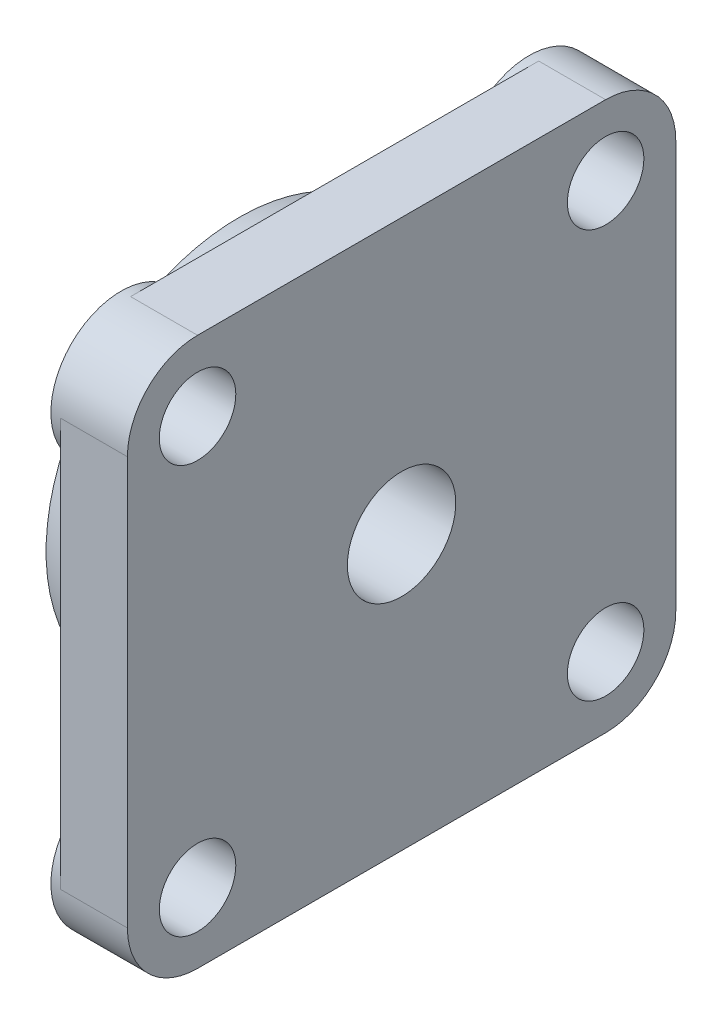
ISO-10303-21;
HEADER;
FILE_DESCRIPTION(('STEP AP214'),'2;1');
FILE_NAME('part.step','',(''),(''),'','','');
FILE_SCHEMA(('AUTOMOTIVE_DESIGN { 1 0 10303 214 1 1 1 1 }'));
ENDSEC;
DATA;
#1=APPLICATION_CONTEXT('core data for automotive mechanical design processes');
#2=APPLICATION_PROTOCOL_DEFINITION('international standard','automotive_design',2000,#1);
#3=PRODUCT_CONTEXT('',#1,'mechanical');
#4=PRODUCT('Part','Part','',(#3));
#5=PRODUCT_RELATED_PRODUCT_CATEGORY('part','',(#4));
#6=PRODUCT_DEFINITION_FORMATION('','',#4);
#7=PRODUCT_DEFINITION_CONTEXT('part definition',#1,'design');
#8=PRODUCT_DEFINITION('design','',#6,#7);
#9=PRODUCT_DEFINITION_SHAPE('','',#8);
#10=(LENGTH_UNIT() NAMED_UNIT(*) SI_UNIT(.MILLI.,.METRE.));
#11=(NAMED_UNIT(*) PLANE_ANGLE_UNIT() SI_UNIT($,.RADIAN.));
#12=(NAMED_UNIT(*) SI_UNIT($,.STERADIAN.) SOLID_ANGLE_UNIT());
#13=UNCERTAINTY_MEASURE_WITH_UNIT(LENGTH_MEASURE(1.E-05),#10,'distance_accuracy_value','');
#14=(GEOMETRIC_REPRESENTATION_CONTEXT(3) GLOBAL_UNCERTAINTY_ASSIGNED_CONTEXT((#13)) GLOBAL_UNIT_ASSIGNED_CONTEXT((#10,
#11,#12)) REPRESENTATION_CONTEXT('',''));
#15=CARTESIAN_POINT('',(0.,0.,0.));
#16=DIRECTION('',(0.,0.,1.));
#17=DIRECTION('',(1.,0.,0.));
#18=AXIS2_PLACEMENT_3D('',#15,#16,#17);
#19=CARTESIAN_POINT('',(-12.,-15.8419293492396,-27.7074869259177));
#20=CARTESIAN_POINT('',(-12.,-15.8419293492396,-35.1684321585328));
#21=CARTESIAN_POINT('',(-12.,-15.8419293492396,-35.2430416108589));
#22=CARTESIAN_POINT('',(-12.,-15.8419293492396,-35.6056914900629));
#23=B_SPLINE_CURVE_WITH_KNOTS('',1,(#19,#20,#21,#22),.UNSPECIFIED.,.F.,.F.,(2,1,1,2),(0.,1.,
1.01,1.05860642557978),.UNSPECIFIED.);
#24=DIRECTION('',(0.,1.,0.));
#25=VECTOR('',#24,1.);
#26=SURFACE_OF_LINEAR_EXTRUSION('',#23,#25);
#27=CARTESIAN_POINT('',(-12.,0.,0.));
#28=DIRECTION('',(1.,0.,0.));
#29=DIRECTION('',(0.,0.,-1.));
#30=AXIS2_PLACEMENT_3D('',#27,#28,#29);
#31=CIRCLE('',#30,30.254833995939);
#32=CARTESIAN_POINT('',(-12.,-12.1511377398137,-27.7074869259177));
#33=VERTEX_POINT('',#32);
#34=CARTESIAN_POINT('',(-12.,12.1511377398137,-27.7074869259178));
#35=VERTEX_POINT('',#34);
#36=EDGE_CURVE('E516',#33,#35,#31,.T.);
#37=ORIENTED_EDGE('',*,*,#36,.F.);
#38=DIRECTION('',(0.,0.707106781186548,0.707106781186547));
#39=VECTOR('',#38,1.);
#40=CARTESIAN_POINT('',(-12.,-18.1864815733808,-33.7428307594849));
#41=LINE('',#40,#39);
#42=CARTESIAN_POINT('',(-12.,-15.8419293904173,-31.3982785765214));
#43=VERTEX_POINT('',#42);
#44=EDGE_CURVE('E961',#43,#33,#41,.T.);
#45=ORIENTED_EDGE('',*,*,#44,.F.);
#46=CARTESIAN_POINT('',(-12.,0.,0.));
#47=DIRECTION('',(1.,0.,0.));
#48=DIRECTION('',(0.,0.,-1.));
#49=AXIS2_PLACEMENT_3D('',#46,#47,#48);
#50=CIRCLE('',#49,35.1684321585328);
#51=CARTESIAN_POINT('',(-12.,15.8419293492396,-31.3982785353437));
#52=VERTEX_POINT('',#51);
#53=EDGE_CURVE('E512',#52,#43,#50,.F.);
#54=ORIENTED_EDGE('',*,*,#53,.F.);
#55=DIRECTION('',(0.,0.707106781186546,-0.707106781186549));
#56=VECTOR('',#55,1.);
#57=CARTESIAN_POINT('',(-12.,18.1864815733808,-33.7428307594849));
#58=LINE('',#57,#56);
#59=EDGE_CURVE('E233',#35,#52,#58,.T.);
#60=ORIENTED_EDGE('',*,*,#59,.F.);
#61=EDGE_LOOP('',(#37,#45,#54,#60));
#62=FACE_BOUND('',#61,.T.);
#63=ADVANCED_FACE('F16',(#62),#26,.T.);
#64=CARTESIAN_POINT('',(-12.,-35.2131978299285,15.8419293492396));
#65=DIRECTION('',(1.,0.,0.));
#66=DIRECTION('',(0.,0.,-1.));
#67=AXIS2_PLACEMENT_3D('',#64,#65,#66);
#68=PLANE('',#67);
#69=DIRECTION('',(0.,0.707106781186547,-0.707106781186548));
#70=VECTOR('',#69,1.);
#71=CARTESIAN_POINT('',(-12.,-33.7428307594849,18.1864815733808));
#72=LINE('',#71,#70);
#73=CARTESIAN_POINT('',(-12.,-31.3982785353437,15.8419293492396));
#74=VERTEX_POINT('',#73);
#75=CARTESIAN_POINT('',(-12.,-27.7074869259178,12.1511377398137));
#76=VERTEX_POINT('',#75);
#77=EDGE_CURVE('E405',#74,#76,#72,.T.);
#78=ORIENTED_EDGE('',*,*,#77,.F.);
#79=CARTESIAN_POINT('',(-12.,0.,0.));
#80=DIRECTION('',(1.,0.,0.));
#81=DIRECTION('',(0.,0.,-1.));
#82=AXIS2_PLACEMENT_3D('',#79,#80,#81);
#83=CIRCLE('',#82,35.1684321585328);
#84=CARTESIAN_POINT('',(-12.,-31.3982785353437,-15.8419293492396));
#85=VERTEX_POINT('',#84);
#86=EDGE_CURVE('E509',#85,#74,#83,.F.);
#87=ORIENTED_EDGE('',*,*,#86,.F.);
#88=DIRECTION('',(0.,-0.707106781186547,-0.707106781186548));
#89=VECTOR('',#88,1.);
#90=CARTESIAN_POINT('',(-12.,-33.7428307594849,-18.1864815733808));
#91=LINE('',#90,#89);
#92=CARTESIAN_POINT('',(-12.,-27.7074869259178,-12.1511377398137));
#93=VERTEX_POINT('',#92);
#94=EDGE_CURVE('E311',#93,#85,#91,.T.);
#95=ORIENTED_EDGE('',*,*,#94,.F.);
#96=CARTESIAN_POINT('',(-12.,0.,0.));
#97=DIRECTION('',(1.,0.,0.));
#98=DIRECTION('',(0.,0.,-1.));
#99=AXIS2_PLACEMENT_3D('',#96,#97,#98);
#100=CIRCLE('',#99,30.254833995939);
#101=EDGE_CURVE('E209',#76,#93,#100,.T.);
#102=ORIENTED_EDGE('',*,*,#101,.F.);
#103=EDGE_LOOP('',(#78,#87,#95,#102));
#104=FACE_BOUND('',#103,.T.);
#105=ADVANCED_FACE('F526',(#104),#68,.T.);
#106=CARTESIAN_POINT('',(-12.,-15.8419293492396,35.6056914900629));
#107=CARTESIAN_POINT('',(-12.,-15.8419293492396,35.2430416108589));
#108=CARTESIAN_POINT('',(-12.,-15.8419293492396,35.1684321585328));
#109=CARTESIAN_POINT('',(-12.,-15.8419293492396,27.7074869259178));
#110=B_SPLINE_CURVE_WITH_KNOTS('',1,(#106,#107,#108,#109),.UNSPECIFIED.,.F.,.F.,(2,1,1,2),
(-0.0586064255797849,-0.01,0.,1.),.UNSPECIFIED.);
#111=DIRECTION('',(0.,1.,0.));
#112=VECTOR('',#111,1.);
#113=SURFACE_OF_LINEAR_EXTRUSION('',#110,#112);
#114=CARTESIAN_POINT('',(-12.,0.,0.));
#115=DIRECTION('',(1.,0.,0.));
#116=DIRECTION('',(0.,0.,-1.));
#117=AXIS2_PLACEMENT_3D('',#114,#115,#116);
#118=CIRCLE('',#117,30.254833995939);
#119=CARTESIAN_POINT('',(-12.,12.1511377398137,27.7074869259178));
#120=VERTEX_POINT('',#119);
#121=CARTESIAN_POINT('',(-12.,-12.1511377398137,27.7074869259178));
#122=VERTEX_POINT('',#121);
#123=EDGE_CURVE('E20',#120,#122,#118,.T.);
#124=ORIENTED_EDGE('',*,*,#123,.F.);
#125=DIRECTION('',(0.,-0.707106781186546,-0.707106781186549));
#126=VECTOR('',#125,1.);
#127=CARTESIAN_POINT('',(-12.,18.1864815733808,33.7428307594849));
#128=LINE('',#127,#126);
#129=CARTESIAN_POINT('',(-12.,15.8419295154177,31.3982787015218));
#130=VERTEX_POINT('',#129);
#131=EDGE_CURVE('E203',#130,#120,#128,.T.);
#132=ORIENTED_EDGE('',*,*,#131,.F.);
#133=CARTESIAN_POINT('',(-12.,0.,0.));
#134=DIRECTION('',(1.,0.,0.));
#135=DIRECTION('',(0.,0.,-1.));
#136=AXIS2_PLACEMENT_3D('',#133,#134,#135);
#137=CIRCLE('',#136,35.1684321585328);
#138=CARTESIAN_POINT('',(-12.,-15.8419293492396,31.3982785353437));
#139=VERTEX_POINT('',#138);
#140=EDGE_CURVE('E507',#139,#130,#137,.F.);
#141=ORIENTED_EDGE('',*,*,#140,.F.);
#142=DIRECTION('',(0.,-0.707106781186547,0.707106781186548));
#143=VECTOR('',#142,1.);
#144=CARTESIAN_POINT('',(-12.,-18.1864815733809,33.7428307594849));
#145=LINE('',#144,#143);
#146=EDGE_CURVE('E206',#122,#139,#145,.T.);
#147=ORIENTED_EDGE('',*,*,#146,.F.);
#148=EDGE_LOOP('',(#124,#132,#141,#147));
#149=FACE_BOUND('',#148,.T.);
#150=ADVANCED_FACE('F201',(#149),#113,.T.);
#151=CARTESIAN_POINT('',(-12.,27.6627212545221,15.8419293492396));
#152=DIRECTION('',(1.,0.,0.));
#153=DIRECTION('',(0.,0.,-1.));
#154=AXIS2_PLACEMENT_3D('',#151,#152,#153);
#155=PLANE('',#154);
#156=DIRECTION('',(0.,-0.707106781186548,0.707106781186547));
#157=VECTOR('',#156,1.);
#158=CARTESIAN_POINT('',(-12.,33.7428307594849,-18.1864815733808));
#159=LINE('',#158,#157);
#160=CARTESIAN_POINT('',(-12.,31.3982785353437,-15.8419293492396));
#161=VERTEX_POINT('',#160);
#162=CARTESIAN_POINT('',(-12.,27.7074869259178,-12.1511377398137));
#163=VERTEX_POINT('',#162);
#164=EDGE_CURVE('E237',#161,#163,#159,.T.);
#165=ORIENTED_EDGE('',*,*,#164,.F.);
#166=CARTESIAN_POINT('',(-12.,0.,0.));
#167=DIRECTION('',(1.,0.,0.));
#168=DIRECTION('',(0.,0.,-1.));
#169=AXIS2_PLACEMENT_3D('',#166,#167,#168);
#170=CIRCLE('',#169,35.1684321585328);
#171=CARTESIAN_POINT('',(-12.,31.3982785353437,15.8419293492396));
#172=VERTEX_POINT('',#171);
#173=EDGE_CURVE('E432',#172,#161,#170,.F.);
#174=ORIENTED_EDGE('',*,*,#173,.F.);
#175=DIRECTION('',(0.,0.707106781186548,0.707106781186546));
#176=VECTOR('',#175,1.);
#177=CARTESIAN_POINT('',(-12.,33.7428307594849,18.1864815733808));
#178=LINE('',#177,#176);
#179=CARTESIAN_POINT('',(-12.,27.7074869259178,12.1511377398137));
#180=VERTEX_POINT('',#179);
#181=EDGE_CURVE('E319',#180,#172,#178,.T.);
#182=ORIENTED_EDGE('',*,*,#181,.F.);
#183=CARTESIAN_POINT('',(-12.,0.,0.));
#184=DIRECTION('',(1.,0.,0.));
#185=DIRECTION('',(0.,0.,-1.));
#186=AXIS2_PLACEMENT_3D('',#183,#184,#185);
#187=CIRCLE('',#186,30.2548339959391);
#188=EDGE_CURVE('E401',#163,#180,#187,.T.);
#189=ORIENTED_EDGE('',*,*,#188,.F.);
#190=EDGE_LOOP('',(#165,#174,#182,#189));
#191=FACE_BOUND('',#190,.T.);
#192=ADVANCED_FACE('F932',(#191),#155,.T.);
#193=CARTESIAN_POINT('',(-10.5,0.,0.));
#194=DIRECTION('',(1.,0.,0.));
#195=DIRECTION('',(0.,0.,-1.));
#196=AXIS2_PLACEMENT_3D('',#193,#194,#195);
#197=CYLINDRICAL_SURFACE('',#196,30.254833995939);
#198=ORIENTED_EDGE('',*,*,#123,.T.);
#199=DIRECTION('',(1.,0.,0.));
#200=VECTOR('',#199,1.);
#201=CARTESIAN_POINT('',(-12.,-12.1511377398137,27.7074869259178));
#202=LINE('',#201,#200);
#203=CARTESIAN_POINT('',(-10.5,-12.1511377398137,27.7074869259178));
#204=VERTEX_POINT('',#203);
#205=EDGE_CURVE('E411',#204,#122,#202,.F.);
#206=ORIENTED_EDGE('',*,*,#205,.F.);
#207=CARTESIAN_POINT('',(-10.5,0.,0.));
#208=DIRECTION('',(1.,0.,0.));
#209=DIRECTION('',(0.,0.,-1.));
#210=AXIS2_PLACEMENT_3D('',#207,#208,#209);
#211=CIRCLE('',#210,30.254833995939);
#212=CARTESIAN_POINT('',(-10.5,12.1511377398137,27.7074869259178));
#213=VERTEX_POINT('',#212);
#214=EDGE_CURVE('E214',#213,#204,#211,.T.);
#215=ORIENTED_EDGE('',*,*,#214,.F.);
#216=DIRECTION('',(1.,0.,0.));
#217=VECTOR('',#216,1.);
#218=CARTESIAN_POINT('',(-12.,12.1511377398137,27.7074869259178));
#219=LINE('',#218,#217);
#220=EDGE_CURVE('E211',#120,#213,#219,.T.);
#221=ORIENTED_EDGE('',*,*,#220,.F.);
#222=EDGE_LOOP('',(#198,#206,#215,#221));
#223=FACE_BOUND('',#222,.T.);
#224=ADVANCED_FACE('F212',(#223),#197,.T.);
#225=CARTESIAN_POINT('',(-10.5,0.,0.));
#226=DIRECTION('',(1.,0.,0.));
#227=DIRECTION('',(0.,0.,-1.));
#228=AXIS2_PLACEMENT_3D('',#225,#226,#227);
#229=CYLINDRICAL_SURFACE('',#228,30.254833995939);
#230=ORIENTED_EDGE('',*,*,#101,.T.);
#231=DIRECTION('',(1.,0.,0.));
#232=VECTOR('',#231,1.);
#233=CARTESIAN_POINT('',(-12.,-27.7074869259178,-12.1511377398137));
#234=LINE('',#233,#232);
#235=CARTESIAN_POINT('',(-10.5,-27.7074869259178,-12.1511377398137));
#236=VERTEX_POINT('',#235);
#237=EDGE_CURVE('E393',#236,#93,#234,.F.);
#238=ORIENTED_EDGE('',*,*,#237,.F.);
#239=CARTESIAN_POINT('',(-10.5,0.,0.));
#240=DIRECTION('',(1.,0.,0.));
#241=DIRECTION('',(0.,0.,-1.));
#242=AXIS2_PLACEMENT_3D('',#239,#240,#241);
#243=CIRCLE('',#242,30.254833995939);
#244=CARTESIAN_POINT('',(-10.5,-27.7074869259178,12.1511377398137));
#245=VERTEX_POINT('',#244);
#246=EDGE_CURVE('E392',#245,#236,#243,.T.);
#247=ORIENTED_EDGE('',*,*,#246,.F.);
#248=DIRECTION('',(1.,0.,0.));
#249=VECTOR('',#248,1.);
#250=CARTESIAN_POINT('',(-12.,-27.7074869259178,12.1511377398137));
#251=LINE('',#250,#249);
#252=EDGE_CURVE('E402',#76,#245,#251,.T.);
#253=ORIENTED_EDGE('',*,*,#252,.F.);
#254=EDGE_LOOP('',(#230,#238,#247,#253));
#255=FACE_BOUND('',#254,.T.);
#256=ADVANCED_FACE('F520',(#255),#229,.T.);
#257=CARTESIAN_POINT('',(-10.5,0.,0.));
#258=DIRECTION('',(1.,0.,0.));
#259=DIRECTION('',(0.,0.,-1.));
#260=AXIS2_PLACEMENT_3D('',#257,#258,#259);
#261=CYLINDRICAL_SURFACE('',#260,30.254833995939);
#262=ORIENTED_EDGE('',*,*,#36,.T.);
#263=DIRECTION('',(1.,0.,0.));
#264=VECTOR('',#263,1.);
#265=CARTESIAN_POINT('',(-12.,12.1511377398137,-27.7074869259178));
#266=LINE('',#265,#264);
#267=CARTESIAN_POINT('',(-10.5,12.1511377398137,-27.7074869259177));
#268=VERTEX_POINT('',#267);
#269=EDGE_CURVE('E236',#268,#35,#266,.F.);
#270=ORIENTED_EDGE('',*,*,#269,.F.);
#271=CARTESIAN_POINT('',(-10.5,0.,0.));
#272=DIRECTION('',(1.,0.,0.));
#273=DIRECTION('',(0.,0.,-1.));
#274=AXIS2_PLACEMENT_3D('',#271,#272,#273);
#275=CIRCLE('',#274,30.254833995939);
#276=CARTESIAN_POINT('',(-10.5,-12.1511377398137,-27.7074869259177));
#277=VERTEX_POINT('',#276);
#278=EDGE_CURVE('E326',#277,#268,#275,.T.);
#279=ORIENTED_EDGE('',*,*,#278,.F.);
#280=DIRECTION('',(1.,0.,0.));
#281=VECTOR('',#280,1.);
#282=CARTESIAN_POINT('',(-12.,-12.1511377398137,-27.7074869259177));
#283=LINE('',#282,#281);
#284=EDGE_CURVE('E246',#33,#277,#283,.T.);
#285=ORIENTED_EDGE('',*,*,#284,.F.);
#286=EDGE_LOOP('',(#262,#270,#279,#285));
#287=FACE_BOUND('',#286,.T.);
#288=ADVANCED_FACE('F911',(#287),#261,.T.);
#289=CARTESIAN_POINT('',(-10.5,0.,0.));
#290=DIRECTION('',(1.,0.,0.));
#291=DIRECTION('',(0.,0.,-1.));
#292=AXIS2_PLACEMENT_3D('',#289,#290,#291);
#293=CYLINDRICAL_SURFACE('',#292,30.2548339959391);
#294=ORIENTED_EDGE('',*,*,#188,.T.);
#295=DIRECTION('',(1.,0.,0.));
#296=VECTOR('',#295,1.);
#297=CARTESIAN_POINT('',(-12.,27.7074869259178,12.1511377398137));
#298=LINE('',#297,#296);
#299=CARTESIAN_POINT('',(-10.5,27.7074869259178,12.1511377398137));
#300=VERTEX_POINT('',#299);
#301=EDGE_CURVE('E218',#300,#180,#298,.F.);
#302=ORIENTED_EDGE('',*,*,#301,.F.);
#303=CARTESIAN_POINT('',(-10.5,0.,0.));
#304=DIRECTION('',(1.,0.,0.));
#305=DIRECTION('',(0.,0.,-1.));
#306=AXIS2_PLACEMENT_3D('',#303,#304,#305);
#307=CIRCLE('',#306,30.2548339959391);
#308=CARTESIAN_POINT('',(-10.5,27.7074869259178,-12.1511377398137));
#309=VERTEX_POINT('',#308);
#310=EDGE_CURVE('E310',#309,#300,#307,.T.);
#311=ORIENTED_EDGE('',*,*,#310,.F.);
#312=DIRECTION('',(1.,0.,0.));
#313=VECTOR('',#312,1.);
#314=CARTESIAN_POINT('',(-12.,27.7074869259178,-12.1511377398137));
#315=LINE('',#314,#313);
#316=EDGE_CURVE('E240',#163,#309,#315,.T.);
#317=ORIENTED_EDGE('',*,*,#316,.F.);
#318=EDGE_LOOP('',(#294,#302,#311,#317));
#319=FACE_BOUND('',#318,.T.);
#320=ADVANCED_FACE('F904',(#319),#293,.T.);
#321=CARTESIAN_POINT('',(-12.,-27.7074869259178,-12.1511377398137));
#322=DIRECTION('',(0.,-0.707106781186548,0.707106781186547));
#323=DIRECTION('',(0.,-0.707106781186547,-0.707106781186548));
#324=AXIS2_PLACEMENT_3D('',#321,#322,#323);
#325=PLANE('',#324);
#326=CARTESIAN_POINT('',(-12.,-39.778174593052,-24.221825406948));
#327=CARTESIAN_POINT('',(-12.,-39.4290122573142,-23.8726630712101));
#328=CARTESIAN_POINT('',(-12.,-39.0798499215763,-23.5235007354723));
#329=CARTESIAN_POINT('',(-12.,-38.3815252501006,-22.8251760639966));
#330=CARTESIAN_POINT('',(-12.,-38.0323629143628,-22.4760137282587));
#331=CARTESIAN_POINT('',(-12.,-37.3340382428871,-21.777689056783));
#332=CARTESIAN_POINT('',(-12.,-36.9848759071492,-21.4285267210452));
#333=CARTESIAN_POINT('',(-12.,-36.2865512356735,-20.7302020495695));
#334=CARTESIAN_POINT('',(-12.,-35.9373888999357,-20.3810397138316));
#335=CARTESIAN_POINT('',(-12.,-35.23906422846,-19.6827150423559));
#336=CARTESIAN_POINT('',(-12.,-34.8899018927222,-19.3335527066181));
#337=CARTESIAN_POINT('',(-12.,-34.1915772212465,-18.6352280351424));
#338=CARTESIAN_POINT('',(-12.,-33.8424148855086,-18.2860656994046));
#339=CARTESIAN_POINT('',(-12.,-33.1440902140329,-17.5877410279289));
#340=CARTESIAN_POINT('',(-12.,-32.7949278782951,-17.238578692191));
#341=CARTESIAN_POINT('',(-12.,-32.0966032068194,-16.5402540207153));
#342=CARTESIAN_POINT('',(-12.,-31.7474408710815,-16.1910916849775));
#343=CARTESIAN_POINT('',(-12.,-31.3982785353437,-15.8419293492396));
#344=B_SPLINE_CURVE_WITH_KNOTS('',3,(#326,#327,#328,#329,#330,#331,#332,#333,#334,#335,#336,
#337,#338,#339,#340,#341,#342,#343),.UNSPECIFIED.,.F.,.F.,(4,2,2,2,2,2,2,2,4),(0.,
1.481370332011,2.962740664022,4.44411099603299,5.92548132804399,7.406851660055,8.88822199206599,
10.369592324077,11.850962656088),.UNSPECIFIED.);
#345=CARTESIAN_POINT('',(-12.,-39.778174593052,-24.221825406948));
#346=VERTEX_POINT('',#345);
#347=EDGE_CURVE('E247',#346,#85,#344,.T.);
#348=ORIENTED_EDGE('',*,*,#347,.F.);
#349=DIRECTION('',(-1.,0.,0.));
#350=VECTOR('',#349,1.);
#351=CARTESIAN_POINT('',(-11.25,-39.778174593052,-24.221825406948));
#352=LINE('',#351,#350);
#353=CARTESIAN_POINT('',(-10.5,-39.778174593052,-24.221825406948));
#354=VERTEX_POINT('',#353);
#355=EDGE_CURVE('E243',#354,#346,#352,.T.);
#356=ORIENTED_EDGE('',*,*,#355,.F.);
#357=CARTESIAN_POINT('',(-10.5,-27.7074869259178,-12.1511377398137));
#358=CARTESIAN_POINT('',(-10.5,-28.2104322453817,-12.6540830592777));
#359=CARTESIAN_POINT('',(-10.5,-28.7133775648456,-13.1570283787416));
#360=CARTESIAN_POINT('',(-10.5,-29.7192682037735,-14.1629190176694));
#361=CARTESIAN_POINT('',(-10.5,-30.2222135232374,-14.6658643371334));
#362=CARTESIAN_POINT('',(-10.5,-31.2281041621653,-15.6717549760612));
#363=CARTESIAN_POINT('',(-10.5,-31.7310494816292,-16.1747002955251));
#364=CARTESIAN_POINT('',(-10.5,-32.736940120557,-17.180590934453));
#365=CARTESIAN_POINT('',(-10.5,-33.239885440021,-17.6835362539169));
#366=CARTESIAN_POINT('',(-10.5,-34.2457760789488,-18.6894268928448));
#367=CARTESIAN_POINT('',(-10.5,-34.7487213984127,-19.1923722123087));
#368=CARTESIAN_POINT('',(-10.5,-35.7546120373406,-20.1982628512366));
#369=CARTESIAN_POINT('',(-10.5,-36.2575573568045,-20.7012081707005));
#370=CARTESIAN_POINT('',(-10.5,-37.2634479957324,-21.7070988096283));
#371=CARTESIAN_POINT('',(-10.5,-37.7663933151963,-22.2100441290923));
#372=CARTESIAN_POINT('',(-10.5,-38.7722839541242,-23.2159347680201));
#373=CARTESIAN_POINT('',(-10.5,-39.2752292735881,-23.7188800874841));
#374=CARTESIAN_POINT('',(-10.5,-39.778174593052,-24.221825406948));
#375=B_SPLINE_CURVE_WITH_KNOTS('',3,(#357,#358,#359,#360,#361,#362,#363,#364,#365,#366,#367,
#368,#369,#370,#371,#372,#373,#374),.UNSPECIFIED.,.F.,.F.,(4,2,2,2,2,2,2,2,4),(0.,
2.13381627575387,4.26763255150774,6.4014488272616,8.53526510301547,10.6690813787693,
12.8028976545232,14.9367139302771,17.0705302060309),.UNSPECIFIED.);
#376=EDGE_CURVE('E388',#236,#354,#375,.T.);
#377=ORIENTED_EDGE('',*,*,#376,.F.);
#378=ORIENTED_EDGE('',*,*,#237,.T.);
#379=ORIENTED_EDGE('',*,*,#94,.T.);
#380=EDGE_LOOP('',(#348,#356,#377,#378,#379));
#381=FACE_BOUND('',#380,.T.);
#382=ADVANCED_FACE('F530',(#381),#325,.T.);
#383=CARTESIAN_POINT('',(-12.,-24.221825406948,-39.778174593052));
#384=DIRECTION('',(0.,0.707106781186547,-0.707106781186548));
#385=DIRECTION('',(0.,0.707106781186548,0.707106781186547));
#386=AXIS2_PLACEMENT_3D('',#383,#384,#385);
#387=PLANE('',#386);
#388=ORIENTED_EDGE('',*,*,#44,.T.);
#389=ORIENTED_EDGE('',*,*,#284,.T.);
#390=CARTESIAN_POINT('',(-10.5,-24.221825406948,-39.778174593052));
#391=CARTESIAN_POINT('',(-10.5,-23.718880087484,-39.2752292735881));
#392=CARTESIAN_POINT('',(-10.5,-23.2159347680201,-38.7722839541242));
#393=CARTESIAN_POINT('',(-10.5,-22.2100441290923,-37.7663933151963));
#394=CARTESIAN_POINT('',(-10.5,-21.7070988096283,-37.2634479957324));
#395=CARTESIAN_POINT('',(-10.5,-20.7012081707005,-36.2575573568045));
#396=CARTESIAN_POINT('',(-10.5,-20.1982628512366,-35.7546120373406));
#397=CARTESIAN_POINT('',(-10.5,-19.1923722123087,-34.7487213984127));
#398=CARTESIAN_POINT('',(-10.5,-18.6894268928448,-34.2457760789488));
#399=CARTESIAN_POINT('',(-10.5,-17.6835362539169,-33.239885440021));
#400=CARTESIAN_POINT('',(-10.5,-17.180590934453,-32.736940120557));
#401=CARTESIAN_POINT('',(-10.5,-16.1747002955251,-31.7310494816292));
#402=CARTESIAN_POINT('',(-10.5,-15.6717549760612,-31.2281041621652));
#403=CARTESIAN_POINT('',(-10.5,-14.6658643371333,-30.2222135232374));
#404=CARTESIAN_POINT('',(-10.5,-14.1629190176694,-29.7192682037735));
#405=CARTESIAN_POINT('',(-10.5,-13.1570283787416,-28.7133775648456));
#406=CARTESIAN_POINT('',(-10.5,-12.6540830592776,-28.2104322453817));
#407=CARTESIAN_POINT('',(-10.5,-12.1511377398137,-27.7074869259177));
#408=B_SPLINE_CURVE_WITH_KNOTS('',3,(#390,#391,#392,#393,#394,#395,#396,#397,#398,#399,#400,
#401,#402,#403,#404,#405,#406,#407),.UNSPECIFIED.,.F.,.F.,(4,2,2,2,2,2,2,2,4),(0.,
2.13381627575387,4.26763255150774,6.40144882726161,8.53526510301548,10.6690813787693,
12.8028976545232,14.9367139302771,17.070530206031),.UNSPECIFIED.);
#409=CARTESIAN_POINT('',(-10.5,-24.221825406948,-39.778174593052));
#410=VERTEX_POINT('',#409);
#411=EDGE_CURVE('E350',#410,#277,#408,.T.);
#412=ORIENTED_EDGE('',*,*,#411,.F.);
#413=DIRECTION('',(1.,0.,0.));
#414=VECTOR('',#413,1.);
#415=CARTESIAN_POINT('',(-12.,-24.221825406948,-39.778174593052));
#416=LINE('',#415,#414);
#417=CARTESIAN_POINT('',(-12.,-24.221825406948,-39.778174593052));
#418=VERTEX_POINT('',#417);
#419=EDGE_CURVE('E254',#410,#418,#416,.F.);
#420=ORIENTED_EDGE('',*,*,#419,.T.);
#421=CARTESIAN_POINT('',(-12.,-15.8419293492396,-31.3982785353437));
#422=CARTESIAN_POINT('',(-12.,-16.1910916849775,-31.7474408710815));
#423=CARTESIAN_POINT('',(-12.,-16.5402540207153,-32.0966032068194));
#424=CARTESIAN_POINT('',(-12.,-17.238578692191,-32.7949278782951));
#425=CARTESIAN_POINT('',(-12.,-17.5877410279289,-33.1440902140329));
#426=CARTESIAN_POINT('',(-12.,-18.2860656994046,-33.8424148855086));
#427=CARTESIAN_POINT('',(-12.,-18.6352280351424,-34.1915772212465));
#428=CARTESIAN_POINT('',(-12.,-19.3335527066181,-34.8899018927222));
#429=CARTESIAN_POINT('',(-12.,-19.682715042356,-35.23906422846));
#430=CARTESIAN_POINT('',(-12.,-20.3810397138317,-35.9373888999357));
#431=CARTESIAN_POINT('',(-12.,-20.7302020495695,-36.2865512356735));
#432=CARTESIAN_POINT('',(-12.,-21.4285267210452,-36.9848759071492));
#433=CARTESIAN_POINT('',(-12.,-21.777689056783,-37.3340382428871));
#434=CARTESIAN_POINT('',(-12.,-22.4760137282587,-38.0323629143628));
#435=CARTESIAN_POINT('',(-12.,-22.8251760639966,-38.3815252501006));
#436=CARTESIAN_POINT('',(-12.,-23.5235007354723,-39.0798499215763));
#437=CARTESIAN_POINT('',(-12.,-23.8726630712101,-39.4290122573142));
#438=CARTESIAN_POINT('',(-12.,-24.221825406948,-39.778174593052));
#439=B_SPLINE_CURVE_WITH_KNOTS('',3,(#421,#422,#423,#424,#425,#426,#427,#428,#429,#430,#431,
#432,#433,#434,#435,#436,#437,#438),.UNSPECIFIED.,.F.,.F.,(4,2,2,2,2,2,2,2,4),(0.,
1.481370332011,2.962740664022,4.444110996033,5.925481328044,7.406851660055,8.888221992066,
10.369592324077,11.850962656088),.UNSPECIFIED.);
#440=EDGE_CURVE('E355',#43,#418,#439,.T.);
#441=ORIENTED_EDGE('',*,*,#440,.F.);
#442=EDGE_LOOP('',(#388,#389,#412,#420,#441));
#443=FACE_BOUND('',#442,.T.);
#444=ADVANCED_FACE('F889',(#443),#387,.T.);
#445=CARTESIAN_POINT('',(-12.,39.778174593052,-24.221825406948));
#446=DIRECTION('',(0.,0.707106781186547,0.707106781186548));
#447=DIRECTION('',(0.,-0.707106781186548,0.707106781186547));
#448=AXIS2_PLACEMENT_3D('',#445,#446,#447);
#449=PLANE('',#448);
#450=ORIENTED_EDGE('',*,*,#164,.T.);
#451=ORIENTED_EDGE('',*,*,#316,.T.);
#452=CARTESIAN_POINT('',(-10.5,39.778174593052,-24.221825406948));
#453=CARTESIAN_POINT('',(-10.5,39.2752292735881,-23.718880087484));
#454=CARTESIAN_POINT('',(-10.5,38.7722839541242,-23.2159347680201));
#455=CARTESIAN_POINT('',(-10.5,37.7663933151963,-22.2100441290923));
#456=CARTESIAN_POINT('',(-10.5,37.2634479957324,-21.7070988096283));
#457=CARTESIAN_POINT('',(-10.5,36.2575573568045,-20.7012081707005));
#458=CARTESIAN_POINT('',(-10.5,35.7546120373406,-20.1982628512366));
#459=CARTESIAN_POINT('',(-10.5,34.7487213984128,-19.1923722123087));
#460=CARTESIAN_POINT('',(-10.5,34.2457760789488,-18.6894268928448));
#461=CARTESIAN_POINT('',(-10.5,33.239885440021,-17.6835362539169));
#462=CARTESIAN_POINT('',(-10.5,32.7369401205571,-17.180590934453));
#463=CARTESIAN_POINT('',(-10.5,31.7310494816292,-16.1747002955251));
#464=CARTESIAN_POINT('',(-10.5,31.2281041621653,-15.6717549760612));
#465=CARTESIAN_POINT('',(-10.5,30.2222135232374,-14.6658643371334));
#466=CARTESIAN_POINT('',(-10.5,29.7192682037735,-14.1629190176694));
#467=CARTESIAN_POINT('',(-10.5,28.7133775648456,-13.1570283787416));
#468=CARTESIAN_POINT('',(-10.5,28.2104322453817,-12.6540830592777));
#469=CARTESIAN_POINT('',(-10.5,27.7074869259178,-12.1511377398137));
#470=B_SPLINE_CURVE_WITH_KNOTS('',3,(#452,#453,#454,#455,#456,#457,#458,#459,#460,#461,#462,
#463,#464,#465,#466,#467,#468,#469),.UNSPECIFIED.,.F.,.F.,(4,2,2,2,2,2,2,2,4),(0.,
2.13381627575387,4.26763255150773,6.40144882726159,8.53526510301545,10.6690813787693,
12.8028976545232,14.936713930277,17.0705302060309),.UNSPECIFIED.);
#471=CARTESIAN_POINT('',(-10.5,39.778174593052,-24.221825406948));
#472=VERTEX_POINT('',#471);
#473=EDGE_CURVE('E301',#472,#309,#470,.T.);
#474=ORIENTED_EDGE('',*,*,#473,.F.);
#475=DIRECTION('',(1.,0.,0.));
#476=VECTOR('',#475,1.);
#477=CARTESIAN_POINT('',(-12.,39.778174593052,-24.221825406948));
#478=LINE('',#477,#476);
#479=CARTESIAN_POINT('',(-12.,39.778174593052,-24.221825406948));
#480=VERTEX_POINT('',#479);
#481=EDGE_CURVE('E241',#472,#480,#478,.F.);
#482=ORIENTED_EDGE('',*,*,#481,.T.);
#483=CARTESIAN_POINT('',(-12.,31.3982785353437,-15.8419293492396));
#484=CARTESIAN_POINT('',(-12.,31.7474408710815,-16.1910916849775));
#485=CARTESIAN_POINT('',(-12.,32.0966032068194,-16.5402540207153));
#486=CARTESIAN_POINT('',(-12.,32.7949278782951,-17.238578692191));
#487=CARTESIAN_POINT('',(-12.,33.1440902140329,-17.5877410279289));
#488=CARTESIAN_POINT('',(-12.,33.8424148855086,-18.2860656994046));
#489=CARTESIAN_POINT('',(-12.,34.1915772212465,-18.6352280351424));
#490=CARTESIAN_POINT('',(-12.,34.8899018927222,-19.3335527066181));
#491=CARTESIAN_POINT('',(-12.,35.23906422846,-19.6827150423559));
#492=CARTESIAN_POINT('',(-12.,35.9373888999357,-20.3810397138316));
#493=CARTESIAN_POINT('',(-12.,36.2865512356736,-20.7302020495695));
#494=CARTESIAN_POINT('',(-12.,36.9848759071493,-21.4285267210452));
#495=CARTESIAN_POINT('',(-12.,37.3340382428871,-21.777689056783));
#496=CARTESIAN_POINT('',(-12.,38.0323629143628,-22.4760137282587));
#497=CARTESIAN_POINT('',(-12.,38.3815252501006,-22.8251760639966));
#498=CARTESIAN_POINT('',(-12.,39.0798499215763,-23.5235007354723));
#499=CARTESIAN_POINT('',(-12.,39.4290122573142,-23.8726630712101));
#500=CARTESIAN_POINT('',(-12.,39.778174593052,-24.221825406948));
#501=B_SPLINE_CURVE_WITH_KNOTS('',3,(#483,#484,#485,#486,#487,#488,#489,#490,#491,#492,#493,
#494,#495,#496,#497,#498,#499,#500),.UNSPECIFIED.,.F.,.F.,(4,2,2,2,2,2,2,2,4),(0.,
1.481370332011,2.96274066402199,4.44411099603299,5.92548132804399,7.40685166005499,
8.88822199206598,10.369592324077,11.850962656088),.UNSPECIFIED.);
#502=EDGE_CURVE('E364',#161,#480,#501,.T.);
#503=ORIENTED_EDGE('',*,*,#502,.F.);
#504=EDGE_LOOP('',(#450,#451,#474,#482,#503));
#505=FACE_BOUND('',#504,.T.);
#506=ADVANCED_FACE('F881',(#505),#449,.T.);
#507=CARTESIAN_POINT('',(-12.,12.1511377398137,-27.7074869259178));
#508=DIRECTION('',(0.,-0.707106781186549,-0.707106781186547));
#509=DIRECTION('',(0.,0.707106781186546,-0.707106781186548));
#510=AXIS2_PLACEMENT_3D('',#507,#508,#509);
#511=PLANE('',#510);
#512=CARTESIAN_POINT('',(-12.,24.2218254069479,-39.778174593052));
#513=CARTESIAN_POINT('',(-12.,23.8726630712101,-39.4290122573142));
#514=CARTESIAN_POINT('',(-12.,23.5235007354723,-39.0798499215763));
#515=CARTESIAN_POINT('',(-12.,22.8251760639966,-38.3815252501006));
#516=CARTESIAN_POINT('',(-12.,22.4760137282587,-38.0323629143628));
#517=CARTESIAN_POINT('',(-12.,21.777689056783,-37.3340382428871));
#518=CARTESIAN_POINT('',(-12.,21.4285267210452,-36.9848759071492));
#519=CARTESIAN_POINT('',(-12.,20.7302020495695,-36.2865512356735));
#520=CARTESIAN_POINT('',(-12.,20.3810397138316,-35.9373888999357));
#521=CARTESIAN_POINT('',(-12.,19.6827150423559,-35.23906422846));
#522=CARTESIAN_POINT('',(-12.,19.3335527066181,-34.8899018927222));
#523=CARTESIAN_POINT('',(-12.,18.6352280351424,-34.1915772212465));
#524=CARTESIAN_POINT('',(-12.,18.2860656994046,-33.8424148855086));
#525=CARTESIAN_POINT('',(-12.,17.5877410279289,-33.1440902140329));
#526=CARTESIAN_POINT('',(-12.,17.238578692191,-32.7949278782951));
#527=CARTESIAN_POINT('',(-12.,16.5402540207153,-32.0966032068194));
#528=CARTESIAN_POINT('',(-12.,16.1910916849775,-31.7474408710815));
#529=CARTESIAN_POINT('',(-12.,15.8419293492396,-31.3982785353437));
#530=B_SPLINE_CURVE_WITH_KNOTS('',3,(#512,#513,#514,#515,#516,#517,#518,#519,#520,#521,#522,
#523,#524,#525,#526,#527,#528,#529),.UNSPECIFIED.,.F.,.F.,(4,2,2,2,2,2,2,2,4),(0.,
1.481370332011,2.96274066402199,4.44411099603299,5.92548132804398,7.40685166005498,
8.88822199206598,10.369592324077,11.850962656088),.UNSPECIFIED.);
#531=CARTESIAN_POINT('',(-12.,24.2218254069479,-39.778174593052));
#532=VERTEX_POINT('',#531);
#533=EDGE_CURVE('E277',#532,#52,#530,.T.);
#534=ORIENTED_EDGE('',*,*,#533,.F.);
#535=DIRECTION('',(1.,0.,0.));
#536=VECTOR('',#535,1.);
#537=CARTESIAN_POINT('',(-12.,24.2218254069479,-39.778174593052));
#538=LINE('',#537,#536);
#539=CARTESIAN_POINT('',(-10.5,24.221825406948,-39.778174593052));
#540=VERTEX_POINT('',#539);
#541=EDGE_CURVE('E226',#532,#540,#538,.T.);
#542=ORIENTED_EDGE('',*,*,#541,.T.);
#543=CARTESIAN_POINT('',(-10.5,12.1511377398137,-27.7074869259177));
#544=CARTESIAN_POINT('',(-10.5,12.6540830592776,-28.2104322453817));
#545=CARTESIAN_POINT('',(-10.5,13.1570283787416,-28.7133775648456));
#546=CARTESIAN_POINT('',(-10.5,14.1629190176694,-29.7192682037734));
#547=CARTESIAN_POINT('',(-10.5,14.6658643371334,-30.2222135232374));
#548=CARTESIAN_POINT('',(-10.5,15.6717549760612,-31.2281041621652));
#549=CARTESIAN_POINT('',(-10.5,16.1747002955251,-31.7310494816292));
#550=CARTESIAN_POINT('',(-10.5,17.180590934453,-32.736940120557));
#551=CARTESIAN_POINT('',(-10.5,17.6835362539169,-33.239885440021));
#552=CARTESIAN_POINT('',(-10.5,18.6894268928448,-34.2457760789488));
#553=CARTESIAN_POINT('',(-10.5,19.1923722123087,-34.7487213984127));
#554=CARTESIAN_POINT('',(-10.5,20.1982628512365,-35.7546120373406));
#555=CARTESIAN_POINT('',(-10.5,20.7012081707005,-36.2575573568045));
#556=CARTESIAN_POINT('',(-10.5,21.7070988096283,-37.2634479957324));
#557=CARTESIAN_POINT('',(-10.5,22.2100441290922,-37.7663933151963));
#558=CARTESIAN_POINT('',(-10.5,23.2159347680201,-38.7722839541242));
#559=CARTESIAN_POINT('',(-10.5,23.718880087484,-39.2752292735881));
#560=CARTESIAN_POINT('',(-10.5,24.2218254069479,-39.778174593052));
#561=B_SPLINE_CURVE_WITH_KNOTS('',3,(#543,#544,#545,#546,#547,#548,#549,#550,#551,#552,#553,
#554,#555,#556,#557,#558,#559,#560),.UNSPECIFIED.,.F.,.F.,(4,2,2,2,2,2,2,2,4),(0.,
2.13381627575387,4.26763255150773,6.40144882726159,8.53526510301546,10.6690813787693,
12.8028976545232,14.9367139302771,17.0705302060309),.UNSPECIFIED.);
#562=EDGE_CURVE('E321',#268,#540,#561,.T.);
#563=ORIENTED_EDGE('',*,*,#562,.F.);
#564=ORIENTED_EDGE('',*,*,#269,.T.);
#565=ORIENTED_EDGE('',*,*,#59,.T.);
#566=EDGE_LOOP('',(#534,#542,#563,#564,#565));
#567=FACE_BOUND('',#566,.T.);
#568=ADVANCED_FACE('F874',(#567),#511,.T.);
#569=CARTESIAN_POINT('',(-12.,24.2218254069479,39.778174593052));
#570=DIRECTION('',(0.,-0.707106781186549,0.707106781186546));
#571=DIRECTION('',(0.,-0.707106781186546,-0.707106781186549));
#572=AXIS2_PLACEMENT_3D('',#569,#570,#571);
#573=PLANE('',#572);
#574=ORIENTED_EDGE('',*,*,#131,.T.);
#575=ORIENTED_EDGE('',*,*,#220,.T.);
#576=CARTESIAN_POINT('',(-10.5,24.2218254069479,39.778174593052));
#577=CARTESIAN_POINT('',(-10.5,23.718880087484,39.2752292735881));
#578=CARTESIAN_POINT('',(-10.5,23.2159347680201,38.7722839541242));
#579=CARTESIAN_POINT('',(-10.5,22.2100441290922,37.7663933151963));
#580=CARTESIAN_POINT('',(-10.5,21.7070988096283,37.2634479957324));
#581=CARTESIAN_POINT('',(-10.5,20.7012081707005,36.2575573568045));
#582=CARTESIAN_POINT('',(-10.5,20.1982628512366,35.7546120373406));
#583=CARTESIAN_POINT('',(-10.5,19.1923722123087,34.7487213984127));
#584=CARTESIAN_POINT('',(-10.5,18.6894268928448,34.2457760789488));
#585=CARTESIAN_POINT('',(-10.5,17.6835362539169,33.239885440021));
#586=CARTESIAN_POINT('',(-10.5,17.180590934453,32.736940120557));
#587=CARTESIAN_POINT('',(-10.5,16.1747002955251,31.7310494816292));
#588=CARTESIAN_POINT('',(-10.5,15.6717549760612,31.2281041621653));
#589=CARTESIAN_POINT('',(-10.5,14.6658643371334,30.2222135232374));
#590=CARTESIAN_POINT('',(-10.5,14.1629190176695,29.7192682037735));
#591=CARTESIAN_POINT('',(-10.5,13.1570283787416,28.7133775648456));
#592=CARTESIAN_POINT('',(-10.5,12.6540830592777,28.2104322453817));
#593=CARTESIAN_POINT('',(-10.5,12.1511377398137,27.7074869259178));
#594=B_SPLINE_CURVE_WITH_KNOTS('',3,(#576,#577,#578,#579,#580,#581,#582,#583,#584,#585,#586,
#587,#588,#589,#590,#591,#592,#593),.UNSPECIFIED.,.F.,.F.,(4,2,2,2,2,2,2,2,4),(0.,
2.13381627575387,4.26763255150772,6.40144882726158,8.53526510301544,10.6690813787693,
12.8028976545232,14.936713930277,17.0705302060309),.UNSPECIFIED.);
#595=CARTESIAN_POINT('',(-10.5,24.2218254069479,39.778174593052));
#596=VERTEX_POINT('',#595);
#597=EDGE_CURVE('E426',#596,#213,#594,.T.);
#598=ORIENTED_EDGE('',*,*,#597,.F.);
#599=DIRECTION('',(1.,0.,0.));
#600=VECTOR('',#599,1.);
#601=CARTESIAN_POINT('',(-12.,24.2218254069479,39.778174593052));
#602=LINE('',#601,#600);
#603=CARTESIAN_POINT('',(-12.,24.2218254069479,39.778174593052));
#604=VERTEX_POINT('',#603);
#605=EDGE_CURVE('E224',#596,#604,#602,.F.);
#606=ORIENTED_EDGE('',*,*,#605,.T.);
#607=CARTESIAN_POINT('',(-12.,15.8419293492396,31.3982785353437));
#608=CARTESIAN_POINT('',(-12.,16.1910916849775,31.7474408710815));
#609=CARTESIAN_POINT('',(-12.,16.5402540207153,32.0966032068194));
#610=CARTESIAN_POINT('',(-12.,17.238578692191,32.7949278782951));
#611=CARTESIAN_POINT('',(-12.,17.5877410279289,33.1440902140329));
#612=CARTESIAN_POINT('',(-12.,18.2860656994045,33.8424148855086));
#613=CARTESIAN_POINT('',(-12.,18.6352280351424,34.1915772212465));
#614=CARTESIAN_POINT('',(-12.,19.3335527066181,34.8899018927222));
#615=CARTESIAN_POINT('',(-12.,19.6827150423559,35.23906422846));
#616=CARTESIAN_POINT('',(-12.,20.3810397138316,35.9373888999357));
#617=CARTESIAN_POINT('',(-12.,20.7302020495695,36.2865512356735));
#618=CARTESIAN_POINT('',(-12.,21.4285267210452,36.9848759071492));
#619=CARTESIAN_POINT('',(-12.,21.777689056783,37.3340382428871));
#620=CARTESIAN_POINT('',(-12.,22.4760137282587,38.0323629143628));
#621=CARTESIAN_POINT('',(-12.,22.8251760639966,38.3815252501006));
#622=CARTESIAN_POINT('',(-12.,23.5235007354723,39.0798499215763));
#623=CARTESIAN_POINT('',(-12.,23.8726630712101,39.4290122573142));
#624=CARTESIAN_POINT('',(-12.,24.2218254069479,39.778174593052));
#625=B_SPLINE_CURVE_WITH_KNOTS('',3,(#607,#608,#609,#610,#611,#612,#613,#614,#615,#616,#617,
#618,#619,#620,#621,#622,#623,#624),.UNSPECIFIED.,.F.,.F.,(4,2,2,2,2,2,2,2,4),(0.,
1.481370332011,2.96274066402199,4.44411099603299,5.92548132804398,7.40685166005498,
8.88822199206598,10.369592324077,11.850962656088),.UNSPECIFIED.);
#626=EDGE_CURVE('E222',#130,#604,#625,.T.);
#627=ORIENTED_EDGE('',*,*,#626,.F.);
#628=EDGE_LOOP('',(#574,#575,#598,#606,#627));
#629=FACE_BOUND('',#628,.T.);
#630=ADVANCED_FACE('F220',(#629),#573,.T.);
#631=CARTESIAN_POINT('',(-12.,27.7074869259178,12.1511377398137));
#632=DIRECTION('',(0.,0.707106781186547,-0.707106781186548));
#633=DIRECTION('',(0.,0.707106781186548,0.707106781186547));
#634=AXIS2_PLACEMENT_3D('',#631,#632,#633);
#635=PLANE('',#634);
#636=CARTESIAN_POINT('',(-12.,39.778174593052,24.221825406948));
#637=CARTESIAN_POINT('',(-12.,39.4290122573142,23.8726630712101));
#638=CARTESIAN_POINT('',(-12.,39.0798499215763,23.5235007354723));
#639=CARTESIAN_POINT('',(-12.,38.3815252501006,22.8251760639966));
#640=CARTESIAN_POINT('',(-12.,38.0323629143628,22.4760137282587));
#641=CARTESIAN_POINT('',(-12.,37.3340382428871,21.777689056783));
#642=CARTESIAN_POINT('',(-12.,36.9848759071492,21.4285267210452));
#643=CARTESIAN_POINT('',(-12.,36.2865512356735,20.7302020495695));
#644=CARTESIAN_POINT('',(-12.,35.9373888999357,20.3810397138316));
#645=CARTESIAN_POINT('',(-12.,35.23906422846,19.6827150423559));
#646=CARTESIAN_POINT('',(-12.,34.8899018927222,19.3335527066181));
#647=CARTESIAN_POINT('',(-12.,34.1915772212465,18.6352280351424));
#648=CARTESIAN_POINT('',(-12.,33.8424148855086,18.2860656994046));
#649=CARTESIAN_POINT('',(-12.,33.1440902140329,17.5877410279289));
#650=CARTESIAN_POINT('',(-12.,32.7949278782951,17.238578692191));
#651=CARTESIAN_POINT('',(-12.,32.0966032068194,16.5402540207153));
#652=CARTESIAN_POINT('',(-12.,31.7474408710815,16.1910916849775));
#653=CARTESIAN_POINT('',(-12.,31.3982785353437,15.8419293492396));
#654=B_SPLINE_CURVE_WITH_KNOTS('',3,(#636,#637,#638,#639,#640,#641,#642,#643,#644,#645,#646,
#647,#648,#649,#650,#651,#652,#653),.UNSPECIFIED.,.F.,.F.,(4,2,2,2,2,2,2,2,4),(0.,
1.481370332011,2.962740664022,4.44411099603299,5.92548132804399,7.40685166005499,
8.88822199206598,10.369592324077,11.850962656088),.UNSPECIFIED.);
#655=CARTESIAN_POINT('',(-12.,39.778174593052,24.221825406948));
#656=VERTEX_POINT('',#655);
#657=EDGE_CURVE('E441',#656,#172,#654,.T.);
#658=ORIENTED_EDGE('',*,*,#657,.F.);
#659=DIRECTION('',(1.,0.,0.));
#660=VECTOR('',#659,1.);
#661=CARTESIAN_POINT('',(-12.,39.778174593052,24.221825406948));
#662=LINE('',#661,#660);
#663=CARTESIAN_POINT('',(-10.5,39.778174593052,24.221825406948));
#664=VERTEX_POINT('',#663);
#665=EDGE_CURVE('E229',#656,#664,#662,.T.);
#666=ORIENTED_EDGE('',*,*,#665,.T.);
#667=CARTESIAN_POINT('',(-10.5,27.7074869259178,12.1511377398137));
#668=CARTESIAN_POINT('',(-10.5,28.2104322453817,12.6540830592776));
#669=CARTESIAN_POINT('',(-10.5,28.7133775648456,13.1570283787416));
#670=CARTESIAN_POINT('',(-10.5,29.7192682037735,14.1629190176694));
#671=CARTESIAN_POINT('',(-10.5,30.2222135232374,14.6658643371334));
#672=CARTESIAN_POINT('',(-10.5,31.2281041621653,15.6717549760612));
#673=CARTESIAN_POINT('',(-10.5,31.7310494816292,16.1747002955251));
#674=CARTESIAN_POINT('',(-10.5,32.736940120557,17.180590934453));
#675=CARTESIAN_POINT('',(-10.5,33.239885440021,17.6835362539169));
#676=CARTESIAN_POINT('',(-10.5,34.2457760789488,18.6894268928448));
#677=CARTESIAN_POINT('',(-10.5,34.7487213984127,19.1923722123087));
#678=CARTESIAN_POINT('',(-10.5,35.7546120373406,20.1982628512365));
#679=CARTESIAN_POINT('',(-10.5,36.2575573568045,20.7012081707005));
#680=CARTESIAN_POINT('',(-10.5,37.2634479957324,21.7070988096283));
#681=CARTESIAN_POINT('',(-10.5,37.7663933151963,22.2100441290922));
#682=CARTESIAN_POINT('',(-10.5,38.7722839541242,23.2159347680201));
#683=CARTESIAN_POINT('',(-10.5,39.2752292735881,23.718880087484));
#684=CARTESIAN_POINT('',(-10.5,39.778174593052,24.2218254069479));
#685=B_SPLINE_CURVE_WITH_KNOTS('',3,(#667,#668,#669,#670,#671,#672,#673,#674,#675,#676,#677,
#678,#679,#680,#681,#682,#683,#684),.UNSPECIFIED.,.F.,.F.,(4,2,2,2,2,2,2,2,4),(0.,
2.13381627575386,4.26763255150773,6.40144882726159,8.53526510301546,10.6690813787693,
12.8028976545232,14.936713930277,17.0705302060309),.UNSPECIFIED.);
#686=EDGE_CURVE('E305',#300,#664,#685,.T.);
#687=ORIENTED_EDGE('',*,*,#686,.F.);
#688=ORIENTED_EDGE('',*,*,#301,.T.);
#689=ORIENTED_EDGE('',*,*,#181,.T.);
#690=EDGE_LOOP('',(#658,#666,#687,#688,#689));
#691=FACE_BOUND('',#690,.T.);
#692=ADVANCED_FACE('F861',(#691),#635,.T.);
#693=CARTESIAN_POINT('',(-12.,-12.1511377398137,27.7074869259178));
#694=DIRECTION('',(0.,0.707106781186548,0.707106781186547));
#695=DIRECTION('',(0.,-0.707106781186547,0.707106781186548));
#696=AXIS2_PLACEMENT_3D('',#693,#694,#695);
#697=PLANE('',#696);
#698=CARTESIAN_POINT('',(-12.,-24.221825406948,39.778174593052));
#699=CARTESIAN_POINT('',(-12.,-23.8726630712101,39.4290122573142));
#700=CARTESIAN_POINT('',(-12.,-23.5235007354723,39.0798499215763));
#701=CARTESIAN_POINT('',(-12.,-22.8251760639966,38.3815252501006));
#702=CARTESIAN_POINT('',(-12.,-22.4760137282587,38.0323629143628));
#703=CARTESIAN_POINT('',(-12.,-21.777689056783,37.3340382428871));
#704=CARTESIAN_POINT('',(-12.,-21.4285267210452,36.9848759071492));
#705=CARTESIAN_POINT('',(-12.,-20.7302020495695,36.2865512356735));
#706=CARTESIAN_POINT('',(-12.,-20.3810397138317,35.9373888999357));
#707=CARTESIAN_POINT('',(-12.,-19.682715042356,35.23906422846));
#708=CARTESIAN_POINT('',(-12.,-19.3335527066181,34.8899018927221));
#709=CARTESIAN_POINT('',(-12.,-18.6352280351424,34.1915772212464));
#710=CARTESIAN_POINT('',(-12.,-18.2860656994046,33.8424148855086));
#711=CARTESIAN_POINT('',(-12.,-17.5877410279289,33.1440902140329));
#712=CARTESIAN_POINT('',(-12.,-17.238578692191,32.794927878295));
#713=CARTESIAN_POINT('',(-12.,-16.5402540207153,32.0966032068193));
#714=CARTESIAN_POINT('',(-12.,-16.1910916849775,31.7474408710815));
#715=CARTESIAN_POINT('',(-12.,-15.8419293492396,31.3982785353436));
#716=B_SPLINE_CURVE_WITH_KNOTS('',3,(#698,#699,#700,#701,#702,#703,#704,#705,#706,#707,#708,
#709,#710,#711,#712,#713,#714,#715),.UNSPECIFIED.,.F.,.F.,(4,2,2,2,2,2,2,2,4),(0.,
1.481370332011,2.96274066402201,4.44411099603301,5.92548132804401,7.40685166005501,
8.88822199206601,10.369592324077,11.850962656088),.UNSPECIFIED.);
#717=CARTESIAN_POINT('',(-12.,-24.221825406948,39.778174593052));
#718=VERTEX_POINT('',#717);
#719=EDGE_CURVE('E586',#718,#139,#716,.T.);
#720=ORIENTED_EDGE('',*,*,#719,.F.);
#721=DIRECTION('',(-1.,0.,0.));
#722=VECTOR('',#721,1.);
#723=CARTESIAN_POINT('',(-11.25,-24.221825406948,39.778174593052));
#724=LINE('',#723,#722);
#725=CARTESIAN_POINT('',(-10.5,-24.221825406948,39.778174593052));
#726=VERTEX_POINT('',#725);
#727=EDGE_CURVE('E404',#726,#718,#724,.T.);
#728=ORIENTED_EDGE('',*,*,#727,.F.);
#729=CARTESIAN_POINT('',(-10.5,-12.1511377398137,27.7074869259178));
#730=CARTESIAN_POINT('',(-10.5,-12.6540830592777,28.2104322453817));
#731=CARTESIAN_POINT('',(-10.5,-13.1570283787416,28.7133775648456));
#732=CARTESIAN_POINT('',(-10.5,-14.1629190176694,29.7192682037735));
#733=CARTESIAN_POINT('',(-10.5,-14.6658643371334,30.2222135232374));
#734=CARTESIAN_POINT('',(-10.5,-15.6717549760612,31.2281041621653));
#735=CARTESIAN_POINT('',(-10.5,-16.1747002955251,31.7310494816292));
#736=CARTESIAN_POINT('',(-10.5,-17.180590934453,32.736940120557));
#737=CARTESIAN_POINT('',(-10.5,-17.6835362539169,33.239885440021));
#738=CARTESIAN_POINT('',(-10.5,-18.6894268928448,34.2457760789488));
#739=CARTESIAN_POINT('',(-10.5,-19.1923722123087,34.7487213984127));
#740=CARTESIAN_POINT('',(-10.5,-20.1982628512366,35.7546120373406));
#741=CARTESIAN_POINT('',(-10.5,-20.7012081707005,36.2575573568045));
#742=CARTESIAN_POINT('',(-10.5,-21.7070988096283,37.2634479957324));
#743=CARTESIAN_POINT('',(-10.5,-22.2100441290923,37.7663933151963));
#744=CARTESIAN_POINT('',(-10.5,-23.2159347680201,38.7722839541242));
#745=CARTESIAN_POINT('',(-10.5,-23.7188800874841,39.2752292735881));
#746=CARTESIAN_POINT('',(-10.5,-24.221825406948,39.778174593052));
#747=B_SPLINE_CURVE_WITH_KNOTS('',3,(#729,#730,#731,#732,#733,#734,#735,#736,#737,#738,#739,
#740,#741,#742,#743,#744,#745,#746),.UNSPECIFIED.,.F.,.F.,(4,2,2,2,2,2,2,2,4),(0.,
2.13381627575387,4.26763255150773,6.4014488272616,8.53526510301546,10.6690813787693,
12.8028976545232,14.9367139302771,17.0705302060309),.UNSPECIFIED.);
#748=EDGE_CURVE('E406',#204,#726,#747,.T.);
#749=ORIENTED_EDGE('',*,*,#748,.F.);
#750=ORIENTED_EDGE('',*,*,#205,.T.);
#751=ORIENTED_EDGE('',*,*,#146,.T.);
#752=EDGE_LOOP('',(#720,#728,#749,#750,#751));
#753=FACE_BOUND('',#752,.T.);
#754=ADVANCED_FACE('F565',(#753),#697,.T.);
#755=CARTESIAN_POINT('',(-12.,-39.778174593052,24.221825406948));
#756=DIRECTION('',(0.,-0.707106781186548,-0.707106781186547));
#757=DIRECTION('',(0.,0.707106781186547,-0.707106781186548));
#758=AXIS2_PLACEMENT_3D('',#755,#756,#757);
#759=PLANE('',#758);
#760=ORIENTED_EDGE('',*,*,#77,.T.);
#761=ORIENTED_EDGE('',*,*,#252,.T.);
#762=CARTESIAN_POINT('',(-10.5,-39.778174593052,24.221825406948));
#763=CARTESIAN_POINT('',(-10.5,-39.2752292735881,23.718880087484));
#764=CARTESIAN_POINT('',(-10.5,-38.7722839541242,23.2159347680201));
#765=CARTESIAN_POINT('',(-10.5,-37.7663933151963,22.2100441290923));
#766=CARTESIAN_POINT('',(-10.5,-37.2634479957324,21.7070988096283));
#767=CARTESIAN_POINT('',(-10.5,-36.2575573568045,20.7012081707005));
#768=CARTESIAN_POINT('',(-10.5,-35.7546120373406,20.1982628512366));
#769=CARTESIAN_POINT('',(-10.5,-34.7487213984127,19.1923722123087));
#770=CARTESIAN_POINT('',(-10.5,-34.2457760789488,18.6894268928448));
#771=CARTESIAN_POINT('',(-10.5,-33.239885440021,17.6835362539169));
#772=CARTESIAN_POINT('',(-10.5,-32.736940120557,17.180590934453));
#773=CARTESIAN_POINT('',(-10.5,-31.7310494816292,16.1747002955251));
#774=CARTESIAN_POINT('',(-10.5,-31.2281041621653,15.6717549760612));
#775=CARTESIAN_POINT('',(-10.5,-30.2222135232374,14.6658643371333));
#776=CARTESIAN_POINT('',(-10.5,-29.7192682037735,14.1629190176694));
#777=CARTESIAN_POINT('',(-10.5,-28.7133775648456,13.1570283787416));
#778=CARTESIAN_POINT('',(-10.5,-28.2104322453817,12.6540830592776));
#779=CARTESIAN_POINT('',(-10.5,-27.7074869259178,12.1511377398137));
#780=B_SPLINE_CURVE_WITH_KNOTS('',3,(#762,#763,#764,#765,#766,#767,#768,#769,#770,#771,#772,
#773,#774,#775,#776,#777,#778,#779),.UNSPECIFIED.,.F.,.F.,(4,2,2,2,2,2,2,2,4),(0.,
2.13381627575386,4.26763255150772,6.4014488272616,8.53526510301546,10.6690813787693,
12.8028976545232,14.9367139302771,17.0705302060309),.UNSPECIFIED.);
#781=CARTESIAN_POINT('',(-10.5,-39.778174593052,24.221825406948));
#782=VERTEX_POINT('',#781);
#783=EDGE_CURVE('E384',#782,#245,#780,.T.);
#784=ORIENTED_EDGE('',*,*,#783,.F.);
#785=DIRECTION('',(1.,0.,0.));
#786=VECTOR('',#785,1.);
#787=CARTESIAN_POINT('',(-12.,-39.778174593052,24.221825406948));
#788=LINE('',#787,#786);
#789=CARTESIAN_POINT('',(-12.,-39.778174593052,24.221825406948));
#790=VERTEX_POINT('',#789);
#791=EDGE_CURVE('E541',#782,#790,#788,.F.);
#792=ORIENTED_EDGE('',*,*,#791,.T.);
#793=CARTESIAN_POINT('',(-12.,-31.3982785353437,15.8419293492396));
#794=CARTESIAN_POINT('',(-12.,-31.7474408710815,16.1910916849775));
#795=CARTESIAN_POINT('',(-12.,-32.0966032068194,16.5402540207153));
#796=CARTESIAN_POINT('',(-12.,-32.7949278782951,17.238578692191));
#797=CARTESIAN_POINT('',(-12.,-33.1440902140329,17.5877410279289));
#798=CARTESIAN_POINT('',(-12.,-33.8424148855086,18.2860656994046));
#799=CARTESIAN_POINT('',(-12.,-34.1915772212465,18.6352280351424));
#800=CARTESIAN_POINT('',(-12.,-34.8899018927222,19.3335527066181));
#801=CARTESIAN_POINT('',(-12.,-35.23906422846,19.682715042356));
#802=CARTESIAN_POINT('',(-12.,-35.9373888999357,20.3810397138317));
#803=CARTESIAN_POINT('',(-12.,-36.2865512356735,20.7302020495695));
#804=CARTESIAN_POINT('',(-12.,-36.9848759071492,21.4285267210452));
#805=CARTESIAN_POINT('',(-12.,-37.3340382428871,21.777689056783));
#806=CARTESIAN_POINT('',(-12.,-38.0323629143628,22.4760137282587));
#807=CARTESIAN_POINT('',(-12.,-38.3815252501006,22.8251760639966));
#808=CARTESIAN_POINT('',(-12.,-39.0798499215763,23.5235007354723));
#809=CARTESIAN_POINT('',(-12.,-39.4290122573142,23.8726630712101));
#810=CARTESIAN_POINT('',(-12.,-39.778174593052,24.221825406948));
#811=B_SPLINE_CURVE_WITH_KNOTS('',3,(#793,#794,#795,#796,#797,#798,#799,#800,#801,#802,#803,
#804,#805,#806,#807,#808,#809,#810),.UNSPECIFIED.,.F.,.F.,(4,2,2,2,2,2,2,2,4),(0.,
1.48137033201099,2.962740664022,4.44411099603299,5.925481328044,7.406851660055,8.888221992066,
10.369592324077,11.850962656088),.UNSPECIFIED.);
#812=EDGE_CURVE('E463',#74,#790,#811,.T.);
#813=ORIENTED_EDGE('',*,*,#812,.F.);
#814=EDGE_LOOP('',(#760,#761,#784,#792,#813));
#815=FACE_BOUND('',#814,.T.);
#816=ADVANCED_FACE('F539',(#815),#759,.T.);
#817=CARTESIAN_POINT('',(-25.5,0.,0.));
#818=DIRECTION('',(1.,0.,0.));
#819=DIRECTION('',(0.,0.,-1.));
#820=AXIS2_PLACEMENT_3D('',#817,#818,#819);
#821=CONICAL_SURFACE('',#820,30.254833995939,0.349065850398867);
#822=CARTESIAN_POINT('',(-25.5,0.,0.));
#823=DIRECTION('',(1.,0.,0.));
#824=DIRECTION('',(0.,0.,-1.));
#825=AXIS2_PLACEMENT_3D('',#822,#823,#824);
#826=CIRCLE('',#825,30.254833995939);
#827=CARTESIAN_POINT('',(-25.5,0.,-30.254833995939));
#828=VERTEX_POINT('',#827);
#829=EDGE_CURVE('E579',#828,#828,#826,.F.);
#830=ORIENTED_EDGE('',*,*,#829,.F.);
#831=EDGE_LOOP('',(#830));
#832=FACE_BOUND('',#831,.T.);
#833=CARTESIAN_POINT('',(-12.,0.,0.));
#834=DIRECTION('',(1.,0.,0.));
#835=DIRECTION('',(0.,0.,-1.));
#836=AXIS2_PLACEMENT_3D('',#833,#834,#835);
#837=CIRCLE('',#836,35.1684321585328);
#838=EDGE_CURVE('E491',#172,#130,#837,.T.);
#839=ORIENTED_EDGE('',*,*,#838,.F.);
#840=ORIENTED_EDGE('',*,*,#173,.T.);
#841=CARTESIAN_POINT('',(-12.,0.,0.));
#842=DIRECTION('',(1.,0.,0.));
#843=DIRECTION('',(0.,0.,-1.));
#844=AXIS2_PLACEMENT_3D('',#841,#842,#843);
#845=CIRCLE('',#844,35.1684321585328);
#846=EDGE_CURVE('E442',#52,#161,#845,.T.);
#847=ORIENTED_EDGE('',*,*,#846,.F.);
#848=ORIENTED_EDGE('',*,*,#53,.T.);
#849=CARTESIAN_POINT('',(-12.,0.,0.));
#850=DIRECTION('',(1.,0.,0.));
#851=DIRECTION('',(0.,0.,-1.));
#852=AXIS2_PLACEMENT_3D('',#849,#850,#851);
#853=CIRCLE('',#852,35.1684321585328);
#854=EDGE_CURVE('E252',#85,#43,#853,.T.);
#855=ORIENTED_EDGE('',*,*,#854,.F.);
#856=ORIENTED_EDGE('',*,*,#86,.T.);
#857=CARTESIAN_POINT('',(-12.,0.,0.));
#858=DIRECTION('',(1.,0.,0.));
#859=DIRECTION('',(0.,0.,-1.));
#860=AXIS2_PLACEMENT_3D('',#857,#858,#859);
#861=CIRCLE('',#860,35.1684321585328);
#862=EDGE_CURVE('E585',#139,#74,#861,.T.);
#863=ORIENTED_EDGE('',*,*,#862,.F.);
#864=ORIENTED_EDGE('',*,*,#140,.T.);
#865=EDGE_LOOP('',(#839,#840,#847,#848,#855,#856,#863,#864));
#866=FACE_BOUND('',#865,.T.);
#867=ADVANCED_FACE('F843',(#832,#866),#821,.T.);
#868=CARTESIAN_POINT('',(-10.5,-32.384,27.7074869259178));
#869=DIRECTION('',(-1.,0.,0.));
#870=DIRECTION('',(0.,0.,1.));
#871=AXIS2_PLACEMENT_3D('',#868,#869,#870);
#872=PLANE('',#871);
#873=ORIENTED_EDGE('',*,*,#748,.T.);
#874=CARTESIAN_POINT('',(-10.5,-32.,32.));
#875=DIRECTION('',(-1.,0.,0.));
#876=DIRECTION('',(0.,0.,1.));
#877=AXIS2_PLACEMENT_3D('',#874,#875,#876);
#878=CIRCLE('',#877,11.);
#879=CARTESIAN_POINT('',(-10.5,-32.,43.));
#880=VERTEX_POINT('',#879);
#881=EDGE_CURVE('E410',#726,#880,#878,.F.);
#882=ORIENTED_EDGE('',*,*,#881,.T.);
#883=DIRECTION('',(0.,-1.,0.));
#884=VECTOR('',#883,1.);
#885=CARTESIAN_POINT('',(-10.5,0.,43.));
#886=LINE('',#885,#884);
#887=CARTESIAN_POINT('',(-10.5,32.,43.));
#888=VERTEX_POINT('',#887);
#889=EDGE_CURVE('E374',#888,#880,#886,.T.);
#890=ORIENTED_EDGE('',*,*,#889,.F.);
#891=CARTESIAN_POINT('',(-10.5,32.,32.));
#892=DIRECTION('',(-1.,0.,0.));
#893=DIRECTION('',(0.,0.,1.));
#894=AXIS2_PLACEMENT_3D('',#891,#892,#893);
#895=CIRCLE('',#894,11.);
#896=EDGE_CURVE('E572',#596,#888,#895,.T.);
#897=ORIENTED_EDGE('',*,*,#896,.F.);
#898=ORIENTED_EDGE('',*,*,#597,.T.);
#899=ORIENTED_EDGE('',*,*,#214,.T.);
#900=EDGE_LOOP('',(#873,#882,#890,#897,#898,#899));
#901=FACE_BOUND('',#900,.T.);
#902=ADVANCED_FACE('F419',(#901),#872,.T.);
#903=CARTESIAN_POINT('',(-10.5,-43.,-32.));
#904=DIRECTION('',(-1.,0.,0.));
#905=DIRECTION('',(0.,0.,1.));
#906=AXIS2_PLACEMENT_3D('',#903,#904,#905);
#907=PLANE('',#906);
#908=ORIENTED_EDGE('',*,*,#376,.T.);
#909=CARTESIAN_POINT('',(-10.5,-32.,-32.));
#910=DIRECTION('',(-1.,0.,0.));
#911=DIRECTION('',(0.,0.,1.));
#912=AXIS2_PLACEMENT_3D('',#909,#910,#911);
#913=CIRCLE('',#912,11.);
#914=CARTESIAN_POINT('',(-10.5,-43.,-32.));
#915=VERTEX_POINT('',#914);
#916=EDGE_CURVE('E354',#354,#915,#913,.F.);
#917=ORIENTED_EDGE('',*,*,#916,.T.);
#918=DIRECTION('',(0.,0.,-1.));
#919=VECTOR('',#918,1.);
#920=CARTESIAN_POINT('',(-10.5,-43.,0.));
#921=LINE('',#920,#919);
#922=CARTESIAN_POINT('',(-10.5,-43.,32.));
#923=VERTEX_POINT('',#922);
#924=EDGE_CURVE('E343',#923,#915,#921,.T.);
#925=ORIENTED_EDGE('',*,*,#924,.F.);
#926=CARTESIAN_POINT('',(-10.5,-32.,32.));
#927=DIRECTION('',(-1.,0.,0.));
#928=DIRECTION('',(0.,0.,1.));
#929=AXIS2_PLACEMENT_3D('',#926,#927,#928);
#930=CIRCLE('',#929,11.);
#931=EDGE_CURVE('E537',#782,#923,#930,.T.);
#932=ORIENTED_EDGE('',*,*,#931,.F.);
#933=ORIENTED_EDGE('',*,*,#783,.T.);
#934=ORIENTED_EDGE('',*,*,#246,.T.);
#935=EDGE_LOOP('',(#908,#917,#925,#932,#933,#934));
#936=FACE_BOUND('',#935,.T.);
#937=ADVANCED_FACE('F381',(#936),#907,.T.);
#938=CARTESIAN_POINT('',(-10.5,-32.384,-43.));
#939=DIRECTION('',(-1.,0.,0.));
#940=DIRECTION('',(0.,0.,1.));
#941=AXIS2_PLACEMENT_3D('',#938,#939,#940);
#942=PLANE('',#941);
#943=ORIENTED_EDGE('',*,*,#562,.T.);
#944=CARTESIAN_POINT('',(-10.5,32.,-32.));
#945=DIRECTION('',(-1.,0.,0.));
#946=DIRECTION('',(0.,0.,1.));
#947=AXIS2_PLACEMENT_3D('',#944,#945,#946);
#948=CIRCLE('',#947,11.);
#949=CARTESIAN_POINT('',(-10.5,32.,-43.));
#950=VERTEX_POINT('',#949);
#951=EDGE_CURVE('E325',#540,#950,#948,.F.);
#952=ORIENTED_EDGE('',*,*,#951,.T.);
#953=DIRECTION('',(0.,1.,0.));
#954=VECTOR('',#953,1.);
#955=CARTESIAN_POINT('',(-10.5,0.,-43.));
#956=LINE('',#955,#954);
#957=CARTESIAN_POINT('',(-10.5,-32.,-43.));
#958=VERTEX_POINT('',#957);
#959=EDGE_CURVE('E291',#958,#950,#956,.T.);
#960=ORIENTED_EDGE('',*,*,#959,.F.);
#961=CARTESIAN_POINT('',(-10.5,-32.,-32.));
#962=DIRECTION('',(-1.,0.,0.));
#963=DIRECTION('',(0.,0.,1.));
#964=AXIS2_PLACEMENT_3D('',#961,#962,#963);
#965=CIRCLE('',#964,11.);
#966=EDGE_CURVE('E626',#410,#958,#965,.T.);
#967=ORIENTED_EDGE('',*,*,#966,.F.);
#968=ORIENTED_EDGE('',*,*,#411,.T.);
#969=ORIENTED_EDGE('',*,*,#278,.T.);
#970=EDGE_LOOP('',(#943,#952,#960,#967,#968,#969));
#971=FACE_BOUND('',#970,.T.);
#972=ADVANCED_FACE('F335',(#971),#942,.T.);
#973=CARTESIAN_POINT('',(-10.5,27.6157318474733,-32.));
#974=DIRECTION('',(-1.,0.,0.));
#975=DIRECTION('',(0.,0.,1.));
#976=AXIS2_PLACEMENT_3D('',#973,#974,#975);
#977=PLANE('',#976);
#978=ORIENTED_EDGE('',*,*,#686,.T.);
#979=CARTESIAN_POINT('',(-10.5,32.,32.));
#980=DIRECTION('',(-1.,0.,0.));
#981=DIRECTION('',(0.,0.,1.));
#982=AXIS2_PLACEMENT_3D('',#979,#980,#981);
#983=CIRCLE('',#982,11.);
#984=CARTESIAN_POINT('',(-10.5,43.,32.));
#985=VERTEX_POINT('',#984);
#986=EDGE_CURVE('E253',#664,#985,#983,.F.);
#987=ORIENTED_EDGE('',*,*,#986,.T.);
#988=DIRECTION('',(0.,0.,1.));
#989=VECTOR('',#988,1.);
#990=CARTESIAN_POINT('',(-10.5,43.,0.));
#991=LINE('',#990,#989);
#992=CARTESIAN_POINT('',(-10.5,43.,-32.));
#993=VERTEX_POINT('',#992);
#994=EDGE_CURVE('E279',#993,#985,#991,.T.);
#995=ORIENTED_EDGE('',*,*,#994,.F.);
#996=CARTESIAN_POINT('',(-10.5,32.,-32.));
#997=DIRECTION('',(-1.,0.,0.));
#998=DIRECTION('',(0.,0.,1.));
#999=AXIS2_PLACEMENT_3D('',#996,#997,#998);
#1000=CIRCLE('',#999,11.);
#1001=EDGE_CURVE('E642',#472,#993,#1000,.T.);
#1002=ORIENTED_EDGE('',*,*,#1001,.F.);
#1003=ORIENTED_EDGE('',*,*,#473,.T.);
#1004=ORIENTED_EDGE('',*,*,#310,.T.);
#1005=EDGE_LOOP('',(#978,#987,#995,#1002,#1003,#1004));
#1006=FACE_BOUND('',#1005,.T.);
#1007=ADVANCED_FACE('F298',(#1006),#977,.T.);
#1008=CARTESIAN_POINT('',(-12.,-43.,-15.6789434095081));
#1009=DIRECTION('',(-1.,0.,0.));
#1010=DIRECTION('',(0.,1.,0.));
#1011=AXIS2_PLACEMENT_3D('',#1008,#1009,#1010);
#1012=PLANE('',#1011);
#1013=CARTESIAN_POINT('',(-12.,-32.,-32.));
#1014=DIRECTION('',(1.,0.,0.));
#1015=DIRECTION('',(0.,0.,-1.));
#1016=AXIS2_PLACEMENT_3D('',#1013,#1014,#1015);
#1017=CIRCLE('',#1016,6.);
#1018=CARTESIAN_POINT('',(-12.,-32.,-38.));
#1019=VERTEX_POINT('',#1018);
#1020=EDGE_CURVE('E632',#1019,#1019,#1017,.F.);
#1021=ORIENTED_EDGE('',*,*,#1020,.F.);
#1022=EDGE_LOOP('',(#1021));
#1023=FACE_BOUND('',#1022,.T.);
#1024=CARTESIAN_POINT('',(-12.,-32.,-32.));
#1025=DIRECTION('',(-1.,0.,0.));
#1026=DIRECTION('',(0.,0.,1.));
#1027=AXIS2_PLACEMENT_3D('',#1024,#1025,#1026);
#1028=CIRCLE('',#1027,11.);
#1029=EDGE_CURVE('E618',#346,#418,#1028,.F.);
#1030=ORIENTED_EDGE('',*,*,#1029,.F.);
#1031=ORIENTED_EDGE('',*,*,#347,.T.);
#1032=ORIENTED_EDGE('',*,*,#854,.T.);
#1033=ORIENTED_EDGE('',*,*,#440,.T.);
#1034=EDGE_LOOP('',(#1030,#1031,#1032,#1033));
#1035=FACE_BOUND('',#1034,.T.);
#1036=ADVANCED_FACE('F269',(#1023,#1035),#1012,.T.);
#1037=CARTESIAN_POINT('',(-12.,15.8419293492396,-15.8419293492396));
#1038=CARTESIAN_POINT('',(-12.,43.,-15.8419293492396));
#1039=CARTESIAN_POINT('',(-12.,43.2715807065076,-15.8419293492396));
#1040=B_SPLINE_CURVE_WITH_KNOTS('',1,(#1037,#1038,#1039),.UNSPECIFIED.,.F.,.F.,(2,1,2),(0.,1.,
1.01),.UNSPECIFIED.);
#1041=DIRECTION('',(0.,0.,-1.));
#1042=VECTOR('',#1041,1.);
#1043=SURFACE_OF_LINEAR_EXTRUSION('',#1040,#1042);
#1044=CARTESIAN_POINT('',(-12.,32.,-32.));
#1045=DIRECTION('',(1.,0.,0.));
#1046=DIRECTION('',(0.,0.,-1.));
#1047=AXIS2_PLACEMENT_3D('',#1044,#1045,#1046);
#1048=CIRCLE('',#1047,6.);
#1049=CARTESIAN_POINT('',(-12.,32.,-38.));
#1050=VERTEX_POINT('',#1049);
#1051=EDGE_CURVE('E994',#1050,#1050,#1048,.F.);
#1052=ORIENTED_EDGE('',*,*,#1051,.F.);
#1053=EDGE_LOOP('',(#1052));
#1054=FACE_BOUND('',#1053,.T.);
#1055=ORIENTED_EDGE('',*,*,#533,.T.);
#1056=ORIENTED_EDGE('',*,*,#846,.T.);
#1057=ORIENTED_EDGE('',*,*,#502,.T.);
#1058=CARTESIAN_POINT('',(-12.,32.,-32.));
#1059=DIRECTION('',(-1.,0.,0.));
#1060=DIRECTION('',(0.,0.,1.));
#1061=AXIS2_PLACEMENT_3D('',#1058,#1059,#1060);
#1062=CIRCLE('',#1061,11.);
#1063=EDGE_CURVE('E630',#532,#480,#1062,.F.);
#1064=ORIENTED_EDGE('',*,*,#1063,.F.);
#1065=EDGE_LOOP('',(#1055,#1056,#1057,#1064));
#1066=FACE_BOUND('',#1065,.T.);
#1067=ADVANCED_FACE('F265',(#1054,#1066),#1043,.T.);
#1068=CARTESIAN_POINT('',(-12.,15.8419293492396,43.1692497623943));
#1069=DIRECTION('',(-1.,0.,0.));
#1070=DIRECTION('',(0.,1.,0.));
#1071=AXIS2_PLACEMENT_3D('',#1068,#1069,#1070);
#1072=PLANE('',#1071);
#1073=CARTESIAN_POINT('',(-12.,32.,32.));
#1074=DIRECTION('',(1.,0.,0.));
#1075=DIRECTION('',(0.,0.,-1.));
#1076=AXIS2_PLACEMENT_3D('',#1073,#1074,#1075);
#1077=CIRCLE('',#1076,6.);
#1078=CARTESIAN_POINT('',(-12.,32.,26.));
#1079=VERTEX_POINT('',#1078);
#1080=EDGE_CURVE('E992',#1079,#1079,#1077,.F.);
#1081=ORIENTED_EDGE('',*,*,#1080,.F.);
#1082=EDGE_LOOP('',(#1081));
#1083=FACE_BOUND('',#1082,.T.);
#1084=ORIENTED_EDGE('',*,*,#657,.T.);
#1085=ORIENTED_EDGE('',*,*,#838,.T.);
#1086=ORIENTED_EDGE('',*,*,#626,.T.);
#1087=CARTESIAN_POINT('',(-12.,32.,32.));
#1088=DIRECTION('',(-1.,0.,0.));
#1089=DIRECTION('',(0.,0.,1.));
#1090=AXIS2_PLACEMENT_3D('',#1087,#1088,#1089);
#1091=CIRCLE('',#1090,11.);
#1092=EDGE_CURVE('E577',#656,#604,#1091,.F.);
#1093=ORIENTED_EDGE('',*,*,#1092,.F.);
#1094=EDGE_LOOP('',(#1084,#1085,#1086,#1093));
#1095=FACE_BOUND('',#1094,.T.);
#1096=ADVANCED_FACE('F456',(#1083,#1095),#1072,.T.);
#1097=CARTESIAN_POINT('',(-12.,-43.2715807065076,43.));
#1098=CARTESIAN_POINT('',(-12.,-43.,43.));
#1099=CARTESIAN_POINT('',(-12.,-15.8419293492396,43.));
#1100=B_SPLINE_CURVE_WITH_KNOTS('',1,(#1097,#1098,#1099),.UNSPECIFIED.,.F.,.F.,(2,1,2),(-0.01,
0.,1.),.UNSPECIFIED.);
#1101=DIRECTION('',(0.,0.,-1.));
#1102=VECTOR('',#1101,1.);
#1103=SURFACE_OF_LINEAR_EXTRUSION('',#1100,#1102);
#1104=CARTESIAN_POINT('',(-12.,-32.,32.));
#1105=DIRECTION('',(1.,0.,0.));
#1106=DIRECTION('',(0.,0.,-1.));
#1107=AXIS2_PLACEMENT_3D('',#1104,#1105,#1106);
#1108=CIRCLE('',#1107,6.);
#1109=CARTESIAN_POINT('',(-12.,-32.,26.));
#1110=VERTEX_POINT('',#1109);
#1111=EDGE_CURVE('E989',#1110,#1110,#1108,.F.);
#1112=ORIENTED_EDGE('',*,*,#1111,.F.);
#1113=EDGE_LOOP('',(#1112));
#1114=FACE_BOUND('',#1113,.T.);
#1115=CARTESIAN_POINT('',(-12.,-32.,32.));
#1116=DIRECTION('',(-1.,0.,0.));
#1117=DIRECTION('',(0.,0.,1.));
#1118=AXIS2_PLACEMENT_3D('',#1115,#1116,#1117);
#1119=CIRCLE('',#1118,11.);
#1120=EDGE_CURVE('E608',#718,#790,#1119,.F.);
#1121=ORIENTED_EDGE('',*,*,#1120,.F.);
#1122=ORIENTED_EDGE('',*,*,#719,.T.);
#1123=ORIENTED_EDGE('',*,*,#862,.T.);
#1124=ORIENTED_EDGE('',*,*,#812,.T.);
#1125=EDGE_LOOP('',(#1121,#1122,#1123,#1124));
#1126=FACE_BOUND('',#1125,.T.);
#1127=ADVANCED_FACE('F452',(#1114,#1126),#1103,.T.);
#1128=CARTESIAN_POINT('',(-25.5,-30.254833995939,30.6178930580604));
#1129=DIRECTION('',(-1.,0.,0.));
#1130=DIRECTION('',(0.,1.,0.));
#1131=AXIS2_PLACEMENT_3D('',#1128,#1129,#1130);
#1132=PLANE('',#1131);
#1133=CARTESIAN_POINT('',(-25.5,0.,0.));
#1134=DIRECTION('',(-1.,0.,0.));
#1135=DIRECTION('',(0.,0.,1.));
#1136=AXIS2_PLACEMENT_3D('',#1133,#1134,#1135);
#1137=CIRCLE('',#1136,14.45);
#1138=CARTESIAN_POINT('',(-25.5,0.,14.45));
#1139=VERTEX_POINT('',#1138);
#1140=EDGE_CURVE('E978',#1139,#1139,#1137,.T.);
#1141=ORIENTED_EDGE('',*,*,#1140,.F.);
#1142=EDGE_LOOP('',(#1141));
#1143=FACE_BOUND('',#1142,.T.);
#1144=ORIENTED_EDGE('',*,*,#829,.T.);
#1145=EDGE_LOOP('',(#1144));
#1146=FACE_BOUND('',#1145,.T.);
#1147=ADVANCED_FACE('F659',(#1143,#1146),#1132,.T.);
#1148=CARTESIAN_POINT('',(-12.,32.,32.));
#1149=DIRECTION('',(-1.,0.,0.));
#1150=DIRECTION('',(0.,0.,1.));
#1151=AXIS2_PLACEMENT_3D('',#1148,#1149,#1150);
#1152=CYLINDRICAL_SURFACE('',#1151,11.);
#1153=CARTESIAN_POINT('',(0.,32.,32.));
#1154=DIRECTION('',(-1.,0.,0.));
#1155=DIRECTION('',(0.,0.,1.));
#1156=AXIS2_PLACEMENT_3D('',#1153,#1154,#1155);
#1157=CIRCLE('',#1156,11.);
#1158=CARTESIAN_POINT('',(0.,43.,32.));
#1159=VERTEX_POINT('',#1158);
#1160=CARTESIAN_POINT('',(0.,32.,43.));
#1161=VERTEX_POINT('',#1160);
#1162=EDGE_CURVE('E613',#1159,#1161,#1157,.F.);
#1163=ORIENTED_EDGE('',*,*,#1162,.F.);
#1164=DIRECTION('',(-1.,0.,0.));
#1165=VECTOR('',#1164,1.);
#1166=CARTESIAN_POINT('',(0.,43.,32.));
#1167=LINE('',#1166,#1165);
#1168=EDGE_CURVE('E285',#985,#1159,#1167,.F.);
#1169=ORIENTED_EDGE('',*,*,#1168,.F.);
#1170=ORIENTED_EDGE('',*,*,#986,.F.);
#1171=ORIENTED_EDGE('',*,*,#665,.F.);
#1172=ORIENTED_EDGE('',*,*,#1092,.T.);
#1173=ORIENTED_EDGE('',*,*,#605,.F.);
#1174=ORIENTED_EDGE('',*,*,#896,.T.);
#1175=DIRECTION('',(-1.,0.,0.));
#1176=VECTOR('',#1175,1.);
#1177=CARTESIAN_POINT('',(0.,32.,43.));
#1178=LINE('',#1177,#1176);
#1179=EDGE_CURVE('E605',#1161,#888,#1178,.T.);
#1180=ORIENTED_EDGE('',*,*,#1179,.F.);
#1181=EDGE_LOOP('',(#1163,#1169,#1170,#1171,#1172,#1173,#1174,#1180));
#1182=FACE_BOUND('',#1181,.T.);
#1183=ADVANCED_FACE('F578',(#1182),#1152,.T.);
#1184=CARTESIAN_POINT('',(0.,-32.,43.));
#1185=DIRECTION('',(0.,0.,1.));
#1186=DIRECTION('',(0.,1.,0.));
#1187=AXIS2_PLACEMENT_3D('',#1184,#1185,#1186);
#1188=PLANE('',#1187);
#1189=DIRECTION('',(0.,-1.,0.));
#1190=VECTOR('',#1189,1.);
#1191=CARTESIAN_POINT('',(0.,0.,43.));
#1192=LINE('',#1191,#1190);
#1193=CARTESIAN_POINT('',(0.,-32.,43.));
#1194=VERTEX_POINT('',#1193);
#1195=EDGE_CURVE('E609',#1161,#1194,#1192,.T.);
#1196=ORIENTED_EDGE('',*,*,#1195,.F.);
#1197=ORIENTED_EDGE('',*,*,#1179,.T.);
#1198=ORIENTED_EDGE('',*,*,#889,.T.);
#1199=DIRECTION('',(-1.,0.,0.));
#1200=VECTOR('',#1199,1.);
#1201=CARTESIAN_POINT('',(-6.,-32.,43.));
#1202=LINE('',#1201,#1200);
#1203=EDGE_CURVE('E349',#1194,#880,#1202,.T.);
#1204=ORIENTED_EDGE('',*,*,#1203,.F.);
#1205=EDGE_LOOP('',(#1196,#1197,#1198,#1204));
#1206=FACE_BOUND('',#1205,.T.);
#1207=ADVANCED_FACE('F727',(#1206),#1188,.T.);
#1208=CARTESIAN_POINT('',(-12.,-32.,32.));
#1209=DIRECTION('',(-1.,0.,0.));
#1210=DIRECTION('',(0.,0.,1.));
#1211=AXIS2_PLACEMENT_3D('',#1208,#1209,#1210);
#1212=CYLINDRICAL_SURFACE('',#1211,11.);
#1213=CARTESIAN_POINT('',(0.,-32.,32.));
#1214=DIRECTION('',(-1.,0.,0.));
#1215=DIRECTION('',(0.,0.,1.));
#1216=AXIS2_PLACEMENT_3D('',#1213,#1214,#1215);
#1217=CIRCLE('',#1216,11.);
#1218=CARTESIAN_POINT('',(0.,-43.,32.));
#1219=VERTEX_POINT('',#1218);
#1220=EDGE_CURVE('E612',#1194,#1219,#1217,.F.);
#1221=ORIENTED_EDGE('',*,*,#1220,.F.);
#1222=ORIENTED_EDGE('',*,*,#1203,.T.);
#1223=ORIENTED_EDGE('',*,*,#881,.F.);
#1224=ORIENTED_EDGE('',*,*,#727,.T.);
#1225=ORIENTED_EDGE('',*,*,#1120,.T.);
#1226=ORIENTED_EDGE('',*,*,#791,.F.);
#1227=ORIENTED_EDGE('',*,*,#931,.T.);
#1228=DIRECTION('',(-1.,0.,0.));
#1229=VECTOR('',#1228,1.);
#1230=CARTESIAN_POINT('',(0.,-43.,32.));
#1231=LINE('',#1230,#1229);
#1232=EDGE_CURVE('E348',#1219,#923,#1231,.T.);
#1233=ORIENTED_EDGE('',*,*,#1232,.F.);
#1234=EDGE_LOOP('',(#1221,#1222,#1223,#1224,#1225,#1226,#1227,#1233));
#1235=FACE_BOUND('',#1234,.T.);
#1236=ADVANCED_FACE('F657',(#1235),#1212,.T.);
#1237=CARTESIAN_POINT('',(0.,-43.,-32.));
#1238=DIRECTION('',(0.,-1.,0.));
#1239=DIRECTION('',(0.,0.,1.));
#1240=AXIS2_PLACEMENT_3D('',#1237,#1238,#1239);
#1241=PLANE('',#1240);
#1242=DIRECTION('',(0.,0.,-1.));
#1243=VECTOR('',#1242,1.);
#1244=CARTESIAN_POINT('',(0.,-43.,43.));
#1245=LINE('',#1244,#1243);
#1246=CARTESIAN_POINT('',(0.,-43.,-32.));
#1247=VERTEX_POINT('',#1246);
#1248=EDGE_CURVE('E619',#1219,#1247,#1245,.T.);
#1249=ORIENTED_EDGE('',*,*,#1248,.F.);
#1250=ORIENTED_EDGE('',*,*,#1232,.T.);
#1251=ORIENTED_EDGE('',*,*,#924,.T.);
#1252=DIRECTION('',(-1.,0.,0.));
#1253=VECTOR('',#1252,1.);
#1254=CARTESIAN_POINT('',(-6.,-43.,-32.));
#1255=LINE('',#1254,#1253);
#1256=EDGE_CURVE('E623',#1247,#915,#1255,.T.);
#1257=ORIENTED_EDGE('',*,*,#1256,.F.);
#1258=EDGE_LOOP('',(#1249,#1250,#1251,#1257));
#1259=FACE_BOUND('',#1258,.T.);
#1260=ADVANCED_FACE('F720',(#1259),#1241,.T.);
#1261=CARTESIAN_POINT('',(-12.,-32.,-32.));
#1262=DIRECTION('',(-1.,0.,0.));
#1263=DIRECTION('',(0.,0.,1.));
#1264=AXIS2_PLACEMENT_3D('',#1261,#1262,#1263);
#1265=CYLINDRICAL_SURFACE('',#1264,11.);
#1266=CARTESIAN_POINT('',(0.,-32.,-32.));
#1267=DIRECTION('',(-1.,0.,0.));
#1268=DIRECTION('',(0.,0.,1.));
#1269=AXIS2_PLACEMENT_3D('',#1266,#1267,#1268);
#1270=CIRCLE('',#1269,11.);
#1271=CARTESIAN_POINT('',(0.,-32.,-43.));
#1272=VERTEX_POINT('',#1271);
#1273=EDGE_CURVE('E622',#1247,#1272,#1270,.F.);
#1274=ORIENTED_EDGE('',*,*,#1273,.F.);
#1275=ORIENTED_EDGE('',*,*,#1256,.T.);
#1276=ORIENTED_EDGE('',*,*,#916,.F.);
#1277=ORIENTED_EDGE('',*,*,#355,.T.);
#1278=ORIENTED_EDGE('',*,*,#1029,.T.);
#1279=ORIENTED_EDGE('',*,*,#419,.F.);
#1280=ORIENTED_EDGE('',*,*,#966,.T.);
#1281=DIRECTION('',(-1.,0.,0.));
#1282=VECTOR('',#1281,1.);
#1283=CARTESIAN_POINT('',(0.,-32.,-43.));
#1284=LINE('',#1283,#1282);
#1285=EDGE_CURVE('E627',#1272,#958,#1284,.T.);
#1286=ORIENTED_EDGE('',*,*,#1285,.F.);
#1287=EDGE_LOOP('',(#1274,#1275,#1276,#1277,#1278,#1279,#1280,#1286));
#1288=FACE_BOUND('',#1287,.T.);
#1289=ADVANCED_FACE('F716',(#1288),#1265,.T.);
#1290=CARTESIAN_POINT('',(0.,32.,-43.));
#1291=DIRECTION('',(0.,0.,-1.));
#1292=DIRECTION('',(0.,-1.,0.));
#1293=AXIS2_PLACEMENT_3D('',#1290,#1291,#1292);
#1294=PLANE('',#1293);
#1295=DIRECTION('',(0.,1.,0.));
#1296=VECTOR('',#1295,1.);
#1297=CARTESIAN_POINT('',(0.,0.,-43.));
#1298=LINE('',#1297,#1296);
#1299=CARTESIAN_POINT('',(0.,32.,-43.));
#1300=VERTEX_POINT('',#1299);
#1301=EDGE_CURVE('E638',#1272,#1300,#1298,.T.);
#1302=ORIENTED_EDGE('',*,*,#1301,.F.);
#1303=ORIENTED_EDGE('',*,*,#1285,.T.);
#1304=ORIENTED_EDGE('',*,*,#959,.T.);
#1305=DIRECTION('',(-1.,0.,0.));
#1306=VECTOR('',#1305,1.);
#1307=CARTESIAN_POINT('',(-6.,32.,-43.));
#1308=LINE('',#1307,#1306);
#1309=EDGE_CURVE('E286',#1300,#950,#1308,.T.);
#1310=ORIENTED_EDGE('',*,*,#1309,.F.);
#1311=EDGE_LOOP('',(#1302,#1303,#1304,#1310));
#1312=FACE_BOUND('',#1311,.T.);
#1313=ADVANCED_FACE('F713',(#1312),#1294,.T.);
#1314=CARTESIAN_POINT('',(-12.,32.,-32.));
#1315=DIRECTION('',(-1.,0.,0.));
#1316=DIRECTION('',(0.,0.,1.));
#1317=AXIS2_PLACEMENT_3D('',#1314,#1315,#1316);
#1318=CYLINDRICAL_SURFACE('',#1317,11.);
#1319=CARTESIAN_POINT('',(0.,32.,-32.));
#1320=DIRECTION('',(-1.,0.,0.));
#1321=DIRECTION('',(0.,0.,1.));
#1322=AXIS2_PLACEMENT_3D('',#1319,#1320,#1321);
#1323=CIRCLE('',#1322,11.);
#1324=CARTESIAN_POINT('',(0.,43.,-32.));
#1325=VERTEX_POINT('',#1324);
#1326=EDGE_CURVE('E637',#1300,#1325,#1323,.F.);
#1327=ORIENTED_EDGE('',*,*,#1326,.F.);
#1328=ORIENTED_EDGE('',*,*,#1309,.T.);
#1329=ORIENTED_EDGE('',*,*,#951,.F.);
#1330=ORIENTED_EDGE('',*,*,#541,.F.);
#1331=ORIENTED_EDGE('',*,*,#1063,.T.);
#1332=ORIENTED_EDGE('',*,*,#481,.F.);
#1333=ORIENTED_EDGE('',*,*,#1001,.T.);
#1334=DIRECTION('',(-1.,0.,0.));
#1335=VECTOR('',#1334,1.);
#1336=CARTESIAN_POINT('',(0.,43.,-32.));
#1337=LINE('',#1336,#1335);
#1338=EDGE_CURVE('E35',#1325,#993,#1337,.T.);
#1339=ORIENTED_EDGE('',*,*,#1338,.F.);
#1340=EDGE_LOOP('',(#1327,#1328,#1329,#1330,#1331,#1332,#1333,#1339));
#1341=FACE_BOUND('',#1340,.T.);
#1342=ADVANCED_FACE('F709',(#1341),#1318,.T.);
#1343=CARTESIAN_POINT('',(0.,43.,32.));
#1344=DIRECTION('',(0.,1.,0.));
#1345=DIRECTION('',(0.,0.,-1.));
#1346=AXIS2_PLACEMENT_3D('',#1343,#1344,#1345);
#1347=PLANE('',#1346);
#1348=DIRECTION('',(0.,0.,-1.));
#1349=VECTOR('',#1348,1.);
#1350=CARTESIAN_POINT('',(0.,43.,43.));
#1351=LINE('',#1350,#1349);
#1352=EDGE_CURVE('E633',#1325,#1159,#1351,.F.);
#1353=ORIENTED_EDGE('',*,*,#1352,.F.);
#1354=ORIENTED_EDGE('',*,*,#1338,.T.);
#1355=ORIENTED_EDGE('',*,*,#994,.T.);
#1356=ORIENTED_EDGE('',*,*,#1168,.T.);
#1357=EDGE_LOOP('',(#1353,#1354,#1355,#1356));
#1358=FACE_BOUND('',#1357,.T.);
#1359=ADVANCED_FACE('F705',(#1358),#1347,.T.);
#1360=CARTESIAN_POINT('',(-12.,-32.,-32.));
#1361=DIRECTION('',(1.,0.,0.));
#1362=DIRECTION('',(0.,0.,-1.));
#1363=AXIS2_PLACEMENT_3D('',#1360,#1361,#1362);
#1364=CYLINDRICAL_SURFACE('',#1363,6.);
#1365=CARTESIAN_POINT('',(0.,-32.,-32.));
#1366=DIRECTION('',(1.,0.,0.));
#1367=DIRECTION('',(0.,0.,-1.));
#1368=AXIS2_PLACEMENT_3D('',#1365,#1366,#1367);
#1369=CIRCLE('',#1368,6.);
#1370=CARTESIAN_POINT('',(0.,-32.,-38.));
#1371=VERTEX_POINT('',#1370);
#1372=EDGE_CURVE('E636',#1371,#1371,#1369,.F.);
#1373=ORIENTED_EDGE('',*,*,#1372,.F.);
#1374=EDGE_LOOP('',(#1373));
#1375=FACE_BOUND('',#1374,.T.);
#1376=ORIENTED_EDGE('',*,*,#1020,.T.);
#1377=EDGE_LOOP('',(#1376));
#1378=FACE_BOUND('',#1377,.T.);
#1379=ADVANCED_FACE('F701',(#1375,#1378),#1364,.F.);
#1380=CARTESIAN_POINT('',(-12.,32.,-32.));
#1381=DIRECTION('',(1.,0.,0.));
#1382=DIRECTION('',(0.,0.,-1.));
#1383=AXIS2_PLACEMENT_3D('',#1380,#1381,#1382);
#1384=CYLINDRICAL_SURFACE('',#1383,6.);
#1385=CARTESIAN_POINT('',(0.,32.,-32.));
#1386=DIRECTION('',(1.,0.,0.));
#1387=DIRECTION('',(0.,0.,-1.));
#1388=AXIS2_PLACEMENT_3D('',#1385,#1386,#1387);
#1389=CIRCLE('',#1388,6.);
#1390=CARTESIAN_POINT('',(0.,32.,-38.));
#1391=VERTEX_POINT('',#1390);
#1392=EDGE_CURVE('E1018',#1391,#1391,#1389,.F.);
#1393=ORIENTED_EDGE('',*,*,#1392,.F.);
#1394=EDGE_LOOP('',(#1393));
#1395=FACE_BOUND('',#1394,.T.);
#1396=ORIENTED_EDGE('',*,*,#1051,.T.);
#1397=EDGE_LOOP('',(#1396));
#1398=FACE_BOUND('',#1397,.T.);
#1399=ADVANCED_FACE('F697',(#1395,#1398),#1384,.F.);
#1400=CARTESIAN_POINT('',(-12.,32.,32.));
#1401=DIRECTION('',(1.,0.,0.));
#1402=DIRECTION('',(0.,0.,-1.));
#1403=AXIS2_PLACEMENT_3D('',#1400,#1401,#1402);
#1404=CYLINDRICAL_SURFACE('',#1403,6.);
#1405=CARTESIAN_POINT('',(0.,32.,32.));
#1406=DIRECTION('',(1.,0.,0.));
#1407=DIRECTION('',(0.,0.,-1.));
#1408=AXIS2_PLACEMENT_3D('',#1405,#1406,#1407);
#1409=CIRCLE('',#1408,6.);
#1410=CARTESIAN_POINT('',(0.,32.,26.));
#1411=VERTEX_POINT('',#1410);
#1412=EDGE_CURVE('E1021',#1411,#1411,#1409,.F.);
#1413=ORIENTED_EDGE('',*,*,#1412,.F.);
#1414=EDGE_LOOP('',(#1413));
#1415=FACE_BOUND('',#1414,.T.);
#1416=ORIENTED_EDGE('',*,*,#1080,.T.);
#1417=EDGE_LOOP('',(#1416));
#1418=FACE_BOUND('',#1417,.T.);
#1419=ADVANCED_FACE('F693',(#1415,#1418),#1404,.F.);
#1420=CARTESIAN_POINT('',(-12.,-32.,32.));
#1421=DIRECTION('',(1.,0.,0.));
#1422=DIRECTION('',(0.,0.,-1.));
#1423=AXIS2_PLACEMENT_3D('',#1420,#1421,#1422);
#1424=CYLINDRICAL_SURFACE('',#1423,6.);
#1425=CARTESIAN_POINT('',(0.,-32.,32.));
#1426=DIRECTION('',(1.,0.,0.));
#1427=DIRECTION('',(0.,0.,-1.));
#1428=AXIS2_PLACEMENT_3D('',#1425,#1426,#1427);
#1429=CIRCLE('',#1428,6.);
#1430=CARTESIAN_POINT('',(0.,-32.,26.));
#1431=VERTEX_POINT('',#1430);
#1432=EDGE_CURVE('E1024',#1431,#1431,#1429,.F.);
#1433=ORIENTED_EDGE('',*,*,#1432,.F.);
#1434=EDGE_LOOP('',(#1433));
#1435=FACE_BOUND('',#1434,.T.);
#1436=ORIENTED_EDGE('',*,*,#1111,.T.);
#1437=EDGE_LOOP('',(#1436));
#1438=FACE_BOUND('',#1437,.T.);
#1439=ADVANCED_FACE('F689',(#1435,#1438),#1424,.F.);
#1440=CARTESIAN_POINT('',(-33.3,0.,0.));
#1441=DIRECTION('',(-1.,0.,0.));
#1442=DIRECTION('',(0.,0.,1.));
#1443=AXIS2_PLACEMENT_3D('',#1440,#1441,#1442);
#1444=CYLINDRICAL_SURFACE('',#1443,14.45);
#1445=CARTESIAN_POINT('',(-33.3,0.,0.));
#1446=DIRECTION('',(-1.,0.,0.));
#1447=DIRECTION('',(0.,0.,1.));
#1448=AXIS2_PLACEMENT_3D('',#1445,#1446,#1447);
#1449=CIRCLE('',#1448,14.45);
#1450=CARTESIAN_POINT('',(-33.3,0.,14.45));
#1451=VERTEX_POINT('',#1450);
#1452=EDGE_CURVE('E1027',#1451,#1451,#1449,.T.);
#1453=ORIENTED_EDGE('',*,*,#1452,.F.);
#1454=EDGE_LOOP('',(#1453));
#1455=FACE_BOUND('',#1454,.T.);
#1456=ORIENTED_EDGE('',*,*,#1140,.T.);
#1457=EDGE_LOOP('',(#1456));
#1458=FACE_BOUND('',#1457,.T.);
#1459=ADVANCED_FACE('F685',(#1455,#1458),#1444,.T.);
#1460=CARTESIAN_POINT('',(0.,43.,43.));
#1461=DIRECTION('',(1.,0.,0.));
#1462=DIRECTION('',(0.,-1.,0.));
#1463=AXIS2_PLACEMENT_3D('',#1460,#1461,#1462);
#1464=PLANE('',#1463);
#1465=CARTESIAN_POINT('',(0.,0.,0.));
#1466=DIRECTION('',(-1.,0.,0.));
#1467=DIRECTION('',(0.,0.,1.));
#1468=AXIS2_PLACEMENT_3D('',#1465,#1466,#1467);
#1469=CIRCLE('',#1468,8.5);
#1470=CARTESIAN_POINT('',(0.,0.,8.5));
#1471=VERTEX_POINT('',#1470);
#1472=EDGE_CURVE('E26',#1471,#1471,#1469,.F.);
#1473=ORIENTED_EDGE('',*,*,#1472,.F.);
#1474=EDGE_LOOP('',(#1473));
#1475=FACE_BOUND('',#1474,.T.);
#1476=ORIENTED_EDGE('',*,*,#1432,.T.);
#1477=EDGE_LOOP('',(#1476));
#1478=FACE_BOUND('',#1477,.T.);
#1479=ORIENTED_EDGE('',*,*,#1412,.T.);
#1480=EDGE_LOOP('',(#1479));
#1481=FACE_BOUND('',#1480,.T.);
#1482=ORIENTED_EDGE('',*,*,#1392,.T.);
#1483=EDGE_LOOP('',(#1482));
#1484=FACE_BOUND('',#1483,.T.);
#1485=ORIENTED_EDGE('',*,*,#1372,.T.);
#1486=EDGE_LOOP('',(#1485));
#1487=FACE_BOUND('',#1486,.T.);
#1488=ORIENTED_EDGE('',*,*,#1326,.T.);
#1489=ORIENTED_EDGE('',*,*,#1352,.T.);
#1490=ORIENTED_EDGE('',*,*,#1162,.T.);
#1491=ORIENTED_EDGE('',*,*,#1195,.T.);
#1492=ORIENTED_EDGE('',*,*,#1220,.T.);
#1493=ORIENTED_EDGE('',*,*,#1248,.T.);
#1494=ORIENTED_EDGE('',*,*,#1273,.T.);
#1495=ORIENTED_EDGE('',*,*,#1301,.T.);
#1496=EDGE_LOOP('',(#1488,#1489,#1490,#1491,#1492,#1493,#1494,#1495));
#1497=FACE_BOUND('',#1496,.T.);
#1498=ADVANCED_FACE('F677',(#1475,#1478,#1481,#1484,#1487,#1497),#1464,.T.);
#1499=CARTESIAN_POINT('',(-33.3,-14.45,14.6234021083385));
#1500=DIRECTION('',(-1.,0.,0.));
#1501=DIRECTION('',(0.,1.,0.));
#1502=AXIS2_PLACEMENT_3D('',#1499,#1500,#1501);
#1503=PLANE('',#1502);
#1504=CARTESIAN_POINT('',(-33.3,0.,0.));
#1505=DIRECTION('',(-1.,0.,0.));
#1506=DIRECTION('',(0.,0.,1.));
#1507=AXIS2_PLACEMENT_3D('',#1504,#1505,#1506);
#1508=CIRCLE('',#1507,8.5);
#1509=CARTESIAN_POINT('',(-33.3,0.,8.5));
#1510=VERTEX_POINT('',#1509);
#1511=EDGE_CURVE('E10',#1510,#1510,#1508,.T.);
#1512=ORIENTED_EDGE('',*,*,#1511,.F.);
#1513=EDGE_LOOP('',(#1512));
#1514=FACE_BOUND('',#1513,.T.);
#1515=ORIENTED_EDGE('',*,*,#1452,.T.);
#1516=EDGE_LOOP('',(#1515));
#1517=FACE_BOUND('',#1516,.T.);
#1518=ADVANCED_FACE('F671',(#1514,#1517),#1503,.T.);
#1519=CARTESIAN_POINT('',(0.,0.,0.));
#1520=DIRECTION('',(-1.,0.,0.));
#1521=DIRECTION('',(0.,0.,1.));
#1522=AXIS2_PLACEMENT_3D('',#1519,#1520,#1521);
#1523=CYLINDRICAL_SURFACE('',#1522,8.5);
#1524=ORIENTED_EDGE('',*,*,#1472,.T.);
#1525=EDGE_LOOP('',(#1524));
#1526=FACE_BOUND('',#1525,.T.);
#1527=ORIENTED_EDGE('',*,*,#1511,.T.);
#1528=EDGE_LOOP('',(#1527));
#1529=FACE_BOUND('',#1528,.T.);
#1530=ADVANCED_FACE('F669',(#1526,#1529),#1523,.F.);
#1531=CLOSED_SHELL('',(#63,#105,#150,#192,#224,#256,#288,#320,#382,#444,#506,#568,#630,#692,
#754,#816,#867,#902,#937,#972,#1007,#1036,#1067,#1096,#1127,#1147,#1183,#1207,#1236,#1260,#1289,
#1313,#1342,#1359,#1379,#1399,#1419,#1439,#1459,#1498,#1518,#1530));
#1532=MANIFOLD_SOLID_BREP('B1',#1531);
#1533=ADVANCED_BREP_SHAPE_REPRESENTATION('',(#18,#1532),#14);
#1534=SHAPE_DEFINITION_REPRESENTATION(#9,#1533);
ENDSEC;
END-ISO-10303-21;
